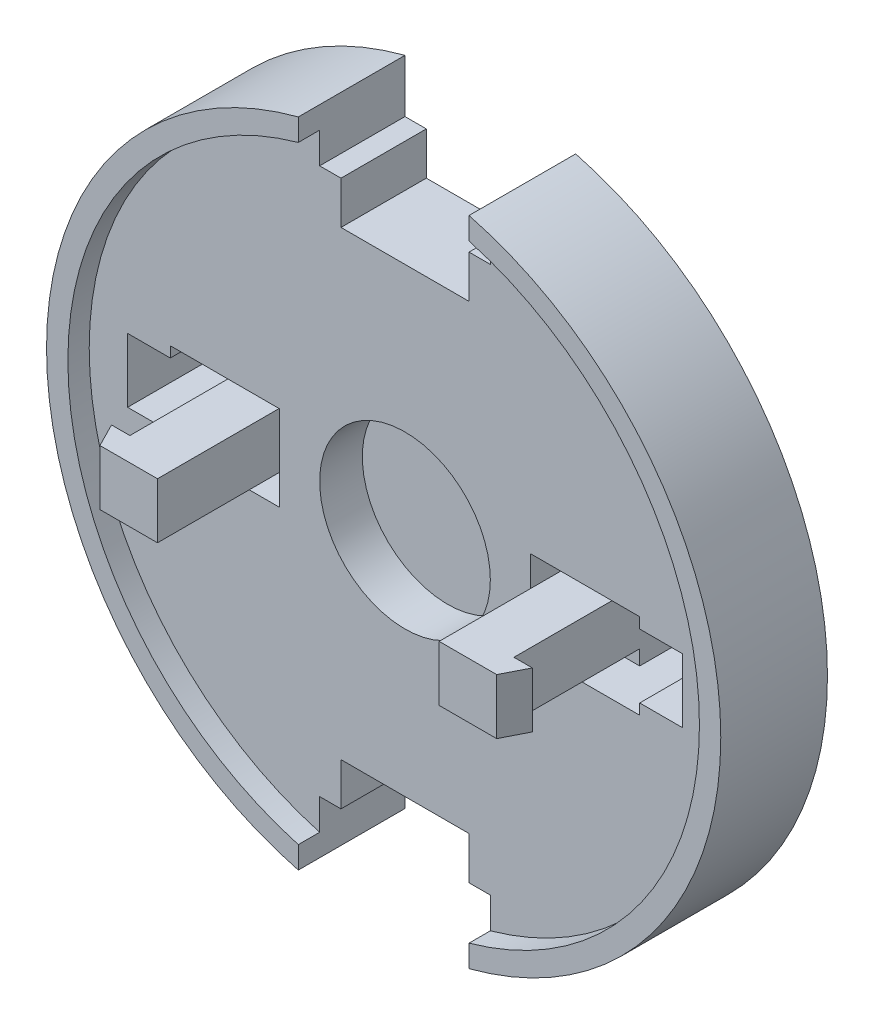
ISO-10303-21;
HEADER;
FILE_DESCRIPTION(('STEP AP214'),'2;1');
FILE_NAME('part.step','',(''),(''),'','','');
FILE_SCHEMA(('AUTOMOTIVE_DESIGN { 1 0 10303 214 1 1 1 1 }'));
ENDSEC;
DATA;
#1=APPLICATION_CONTEXT('core data for automotive mechanical design processes');
#2=APPLICATION_PROTOCOL_DEFINITION('international standard','automotive_design',2000,#1);
#3=PRODUCT_CONTEXT('',#1,'mechanical');
#4=PRODUCT('Part','Part','',(#3));
#5=PRODUCT_RELATED_PRODUCT_CATEGORY('part','',(#4));
#6=PRODUCT_DEFINITION_FORMATION('','',#4);
#7=PRODUCT_DEFINITION_CONTEXT('part definition',#1,'design');
#8=PRODUCT_DEFINITION('design','',#6,#7);
#9=PRODUCT_DEFINITION_SHAPE('','',#8);
#10=(LENGTH_UNIT() NAMED_UNIT(*) SI_UNIT(.MILLI.,.METRE.));
#11=(NAMED_UNIT(*) PLANE_ANGLE_UNIT() SI_UNIT($,.RADIAN.));
#12=(NAMED_UNIT(*) SI_UNIT($,.STERADIAN.) SOLID_ANGLE_UNIT());
#13=UNCERTAINTY_MEASURE_WITH_UNIT(LENGTH_MEASURE(1.E-05),#10,'distance_accuracy_value','');
#14=(GEOMETRIC_REPRESENTATION_CONTEXT(3) GLOBAL_UNCERTAINTY_ASSIGNED_CONTEXT((#13)) GLOBAL_UNIT_ASSIGNED_CONTEXT((#10,
#11,#12)) REPRESENTATION_CONTEXT('',''));
#15=CARTESIAN_POINT('',(0.,0.,0.));
#16=DIRECTION('',(0.,0.,1.));
#17=DIRECTION('',(1.,0.,0.));
#18=AXIS2_PLACEMENT_3D('',#15,#16,#17);
#19=CARTESIAN_POINT('',(4.93052748,-0.65,-9.553084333));
#20=DIRECTION('',(-0.891016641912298,0.,-0.453970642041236));
#21=DIRECTION('',(-0.453970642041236,0.,0.891016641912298));
#22=AXIS2_PLACEMENT_3D('',#19,#20,#21);
#23=PLANE('',#22);
#24=DIRECTION('',(0.,1.,0.));
#25=VECTOR('',#24,1.);
#26=CARTESIAN_POINT('',(4.93052748,0.,-9.553084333));
#27=LINE('',#26,#25);
#28=CARTESIAN_POINT('',(4.93052748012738,-0.65,-9.553084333));
#29=VERTEX_POINT('',#28);
#30=CARTESIAN_POINT('',(4.93052748,0.65,-9.553084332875));
#31=VERTEX_POINT('',#30);
#32=EDGE_CURVE('E175',#29,#31,#27,.T.);
#33=ORIENTED_EDGE('',*,*,#32,.T.);
#34=DIRECTION('',(0.453970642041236,0.,-0.891016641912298));
#35=VECTOR('',#34,1.);
#36=CARTESIAN_POINT('',(4.7896299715,0.65,-9.2765421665));
#37=LINE('',#36,#35);
#38=CARTESIAN_POINT('',(4.64873246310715,0.65,-9.));
#39=VERTEX_POINT('',#38);
#40=EDGE_CURVE('E560',#39,#31,#37,.T.);
#41=ORIENTED_EDGE('',*,*,#40,.F.);
#42=DIRECTION('',(0.,-1.,0.));
#43=VECTOR('',#42,1.);
#44=CARTESIAN_POINT('',(4.648732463,0.,-9.));
#45=LINE('',#44,#43);
#46=CARTESIAN_POINT('',(4.64873246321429,-0.65,-9.));
#47=VERTEX_POINT('',#46);
#48=EDGE_CURVE('E558',#39,#47,#45,.T.);
#49=ORIENTED_EDGE('',*,*,#48,.T.);
#50=DIRECTION('',(-0.4539706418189,0.,0.891016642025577));
#51=VECTOR('',#50,1.);
#52=CARTESIAN_POINT('',(4.93052748,-0.65,-9.5530843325));
#53=LINE('',#52,#51);
#54=EDGE_CURVE('E21',#29,#47,#53,.T.);
#55=ORIENTED_EDGE('',*,*,#54,.F.);
#56=EDGE_LOOP('',(#33,#41,#49,#55));
#57=FACE_BOUND('',#56,.T.);
#58=ADVANCED_FACE('F17',(#57),#23,.F.);
#59=CARTESIAN_POINT('',(4.648732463,-0.65,-9.));
#60=DIRECTION('',(0.,0.,-1.));
#61=DIRECTION('',(-1.,0.,0.));
#62=AXIS2_PLACEMENT_3D('',#59,#60,#61);
#63=PLANE('',#62);
#64=ORIENTED_EDGE('',*,*,#48,.F.);
#65=DIRECTION('',(-1.,0.,0.));
#66=VECTOR('',#65,1.);
#67=CARTESIAN_POINT('',(4.11526374,0.65,-9.));
#68=LINE('',#67,#66);
#69=CARTESIAN_POINT('',(3.3,0.65,-9.));
#70=VERTEX_POINT('',#69);
#71=EDGE_CURVE('E854',#39,#70,#68,.T.);
#72=ORIENTED_EDGE('',*,*,#71,.T.);
#73=DIRECTION('',(0.,-1.,0.));
#74=VECTOR('',#73,1.);
#75=CARTESIAN_POINT('',(3.3,0.,-9.));
#76=LINE('',#75,#74);
#77=CARTESIAN_POINT('',(3.3,-0.65,-9.));
#78=VERTEX_POINT('',#77);
#79=EDGE_CURVE('E862',#70,#78,#76,.T.);
#80=ORIENTED_EDGE('',*,*,#79,.T.);
#81=DIRECTION('',(-1.,0.,0.));
#82=VECTOR('',#81,1.);
#83=CARTESIAN_POINT('',(4.11526374,-0.65,-9.));
#84=LINE('',#83,#82);
#85=EDGE_CURVE('E555',#47,#78,#84,.T.);
#86=ORIENTED_EDGE('',*,*,#85,.F.);
#87=EDGE_LOOP('',(#64,#72,#80,#86));
#88=FACE_BOUND('',#87,.T.);
#89=ADVANCED_FACE('F910',(#88),#63,.F.);
#90=CARTESIAN_POINT('',(3.3,-0.65,-9.));
#91=DIRECTION('',(1.,0.,0.));
#92=DIRECTION('',(0.,0.,-1.));
#93=AXIS2_PLACEMENT_3D('',#90,#91,#92);
#94=PLANE('',#93);
#95=ORIENTED_EDGE('',*,*,#79,.F.);
#96=DIRECTION('',(0.,0.,-1.));
#97=VECTOR('',#96,1.);
#98=CARTESIAN_POINT('',(3.3,0.65,-10.75));
#99=LINE('',#98,#97);
#100=CARTESIAN_POINT('',(3.29999999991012,0.65,-12.5));
#101=VERTEX_POINT('',#100);
#102=EDGE_CURVE('E852',#70,#101,#99,.T.);
#103=ORIENTED_EDGE('',*,*,#102,.T.);
#104=DIRECTION('',(0.,1.,0.));
#105=VECTOR('',#104,1.);
#106=CARTESIAN_POINT('',(3.3,0.,-12.5));
#107=LINE('',#106,#105);
#108=CARTESIAN_POINT('',(3.29999999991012,-0.65,-12.5));
#109=VERTEX_POINT('',#108);
#110=EDGE_CURVE('E192',#109,#101,#107,.T.);
#111=ORIENTED_EDGE('',*,*,#110,.F.);
#112=DIRECTION('',(0.,0.,-1.));
#113=VECTOR('',#112,1.);
#114=CARTESIAN_POINT('',(3.3,-0.65,-10.75));
#115=LINE('',#114,#113);
#116=EDGE_CURVE('E513',#78,#109,#115,.T.);
#117=ORIENTED_EDGE('',*,*,#116,.F.);
#118=EDGE_LOOP('',(#95,#103,#111,#117));
#119=FACE_BOUND('',#118,.T.);
#120=ADVANCED_FACE('F861',(#119),#94,.F.);
#121=CARTESIAN_POINT('',(-4.93052748,-0.65,-9.553084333));
#122=DIRECTION('',(-0.891016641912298,0.,0.453970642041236));
#123=DIRECTION('',(0.453970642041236,0.,0.891016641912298));
#124=AXIS2_PLACEMENT_3D('',#121,#122,#123);
#125=PLANE('',#124);
#126=DIRECTION('',(0.453970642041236,0.,0.891016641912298));
#127=VECTOR('',#126,1.);
#128=CARTESIAN_POINT('',(-4.93052748,0.65,-9.553084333));
#129=LINE('',#128,#127);
#130=CARTESIAN_POINT('',(-4.648732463,0.65,-9.));
#131=VERTEX_POINT('',#130);
#132=CARTESIAN_POINT('',(-4.93052748,0.65,-9.553084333));
#133=VERTEX_POINT('',#132);
#134=EDGE_CURVE('E568',#131,#133,#129,.F.);
#135=ORIENTED_EDGE('',*,*,#134,.T.);
#136=DIRECTION('',(0.,1.,0.));
#137=VECTOR('',#136,1.);
#138=CARTESIAN_POINT('',(-4.93052748,0.,-9.553084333));
#139=LINE('',#138,#137);
#140=CARTESIAN_POINT('',(-4.93052748,-0.65,-9.553084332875));
#141=VERTEX_POINT('',#140);
#142=EDGE_CURVE('E570',#141,#133,#139,.T.);
#143=ORIENTED_EDGE('',*,*,#142,.F.);
#144=DIRECTION('',(0.453970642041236,0.,0.891016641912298));
#145=VECTOR('',#144,1.);
#146=CARTESIAN_POINT('',(-4.7896299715,-0.65,-9.2765421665));
#147=LINE('',#146,#145);
#148=CARTESIAN_POINT('',(-4.64873246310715,-0.65,-9.));
#149=VERTEX_POINT('',#148);
#150=EDGE_CURVE('E865',#141,#149,#147,.T.);
#151=ORIENTED_EDGE('',*,*,#150,.T.);
#152=DIRECTION('',(0.,-1.,0.));
#153=VECTOR('',#152,1.);
#154=CARTESIAN_POINT('',(-4.648732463,0.,-9.));
#155=LINE('',#154,#153);
#156=EDGE_CURVE('E546',#131,#149,#155,.T.);
#157=ORIENTED_EDGE('',*,*,#156,.F.);
#158=EDGE_LOOP('',(#135,#143,#151,#157));
#159=FACE_BOUND('',#158,.T.);
#160=ADVANCED_FACE('F883',(#159),#125,.T.);
#161=CARTESIAN_POINT('',(-3.3,-0.65,-9.));
#162=DIRECTION('',(1.,0.,0.));
#163=DIRECTION('',(0.,0.,-1.));
#164=AXIS2_PLACEMENT_3D('',#161,#162,#163);
#165=PLANE('',#164);
#166=DIRECTION('',(0.,0.,1.));
#167=VECTOR('',#166,1.);
#168=CARTESIAN_POINT('',(-3.3,0.65,-10.75));
#169=LINE('',#168,#167);
#170=CARTESIAN_POINT('',(-3.29999999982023,0.65,-12.5));
#171=VERTEX_POINT('',#170);
#172=CARTESIAN_POINT('',(-3.3,0.65,-9.));
#173=VERTEX_POINT('',#172);
#174=EDGE_CURVE('E573',#171,#173,#169,.T.);
#175=ORIENTED_EDGE('',*,*,#174,.T.);
#176=DIRECTION('',(0.,1.,0.));
#177=VECTOR('',#176,1.);
#178=CARTESIAN_POINT('',(-3.3,0.,-9.));
#179=LINE('',#178,#177);
#180=CARTESIAN_POINT('',(-3.3,-0.65,-9.));
#181=VERTEX_POINT('',#180);
#182=EDGE_CURVE('E564',#181,#173,#179,.T.);
#183=ORIENTED_EDGE('',*,*,#182,.F.);
#184=DIRECTION('',(0.,0.,1.));
#185=VECTOR('',#184,1.);
#186=CARTESIAN_POINT('',(-3.3,-0.65,-10.75));
#187=LINE('',#186,#185);
#188=CARTESIAN_POINT('',(-3.29999999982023,-0.65,-12.5));
#189=VERTEX_POINT('',#188);
#190=EDGE_CURVE('E627',#189,#181,#187,.T.);
#191=ORIENTED_EDGE('',*,*,#190,.F.);
#192=DIRECTION('',(0.,1.,0.));
#193=VECTOR('',#192,1.);
#194=CARTESIAN_POINT('',(-3.3,0.,-12.5));
#195=LINE('',#194,#193);
#196=EDGE_CURVE('E867',#189,#171,#195,.T.);
#197=ORIENTED_EDGE('',*,*,#196,.T.);
#198=EDGE_LOOP('',(#175,#183,#191,#197));
#199=FACE_BOUND('',#198,.T.);
#200=ADVANCED_FACE('F881',(#199),#165,.T.);
#201=CARTESIAN_POINT('',(-4.648732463,-0.65,-9.));
#202=DIRECTION('',(0.,0.,1.));
#203=DIRECTION('',(1.,0.,0.));
#204=AXIS2_PLACEMENT_3D('',#201,#202,#203);
#205=PLANE('',#204);
#206=DIRECTION('',(-1.,0.,0.));
#207=VECTOR('',#206,1.);
#208=CARTESIAN_POINT('',(-4.11526374,0.65,-9.));
#209=LINE('',#208,#207);
#210=EDGE_CURVE('E565',#173,#131,#209,.T.);
#211=ORIENTED_EDGE('',*,*,#210,.T.);
#212=ORIENTED_EDGE('',*,*,#156,.T.);
#213=DIRECTION('',(-1.,0.,0.));
#214=VECTOR('',#213,1.);
#215=CARTESIAN_POINT('',(-4.11526374,-0.65,-9.));
#216=LINE('',#215,#214);
#217=EDGE_CURVE('E624',#181,#149,#216,.T.);
#218=ORIENTED_EDGE('',*,*,#217,.F.);
#219=ORIENTED_EDGE('',*,*,#182,.T.);
#220=EDGE_LOOP('',(#211,#212,#218,#219));
#221=FACE_BOUND('',#220,.T.);
#222=ADVANCED_FACE('F878',(#221),#205,.T.);
#223=CARTESIAN_POINT('',(2.,-7.642643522,-11.));
#224=DIRECTION('',(1.,0.,0.));
#225=DIRECTION('',(0.,0.,-1.));
#226=AXIS2_PLACEMENT_3D('',#223,#224,#225);
#227=PLANE('',#226);
#228=DIRECTION('',(0.,1.,0.));
#229=VECTOR('',#228,1.);
#230=CARTESIAN_POINT('',(2.,-7.021321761,-13.5));
#231=LINE('',#230,#229);
#232=CARTESIAN_POINT('',(2.00000000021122,-7.64264352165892,-13.5));
#233=VERTEX_POINT('',#232);
#234=CARTESIAN_POINT('',(2.,-6.4,-13.5));
#235=VERTEX_POINT('',#234);
#236=EDGE_CURVE('E457',#233,#235,#231,.T.);
#237=ORIENTED_EDGE('',*,*,#236,.F.);
#238=DIRECTION('',(0.,0.,-1.));
#239=VECTOR('',#238,1.);
#240=CARTESIAN_POINT('',(2.00000000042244,-7.64264352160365,-12.25));
#241=LINE('',#240,#239);
#242=CARTESIAN_POINT('',(2.00000000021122,-7.64264352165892,-11.));
#243=VERTEX_POINT('',#242);
#244=EDGE_CURVE('E428',#233,#243,#241,.F.);
#245=ORIENTED_EDGE('',*,*,#244,.T.);
#246=DIRECTION('',(0.,-1.,0.));
#247=VECTOR('',#246,1.);
#248=CARTESIAN_POINT('',(2.,-7.021321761,-11.));
#249=LINE('',#248,#247);
#250=CARTESIAN_POINT('',(2.,-7.12460525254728,-11.));
#251=VERTEX_POINT('',#250);
#252=EDGE_CURVE('E459',#251,#243,#249,.T.);
#253=ORIENTED_EDGE('',*,*,#252,.F.);
#254=DIRECTION('',(0.,0.,1.));
#255=VECTOR('',#254,1.);
#256=CARTESIAN_POINT('',(2.,-7.1246052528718,-12.25));
#257=LINE('',#256,#255);
#258=CARTESIAN_POINT('',(2.,-7.12460525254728,-11.5));
#259=VERTEX_POINT('',#258);
#260=EDGE_CURVE('E463',#259,#251,#257,.T.);
#261=ORIENTED_EDGE('',*,*,#260,.F.);
#262=DIRECTION('',(0.,-1.,0.));
#263=VECTOR('',#262,1.);
#264=CARTESIAN_POINT('',(2.,-7.021321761,-11.5));
#265=LINE('',#264,#263);
#266=CARTESIAN_POINT('',(2.,-6.39999999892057,-11.5));
#267=VERTEX_POINT('',#266);
#268=EDGE_CURVE('E543',#267,#259,#265,.T.);
#269=ORIENTED_EDGE('',*,*,#268,.F.);
#270=DIRECTION('',(0.,0.,-1.));
#271=VECTOR('',#270,1.);
#272=CARTESIAN_POINT('',(2.,-6.4,-12.5));
#273=LINE('',#272,#271);
#274=EDGE_CURVE('E534',#267,#235,#273,.T.);
#275=ORIENTED_EDGE('',*,*,#274,.T.);
#276=EDGE_LOOP('',(#237,#245,#253,#261,#269,#275));
#277=FACE_BOUND('',#276,.T.);
#278=ADVANCED_FACE('F890',(#277),#227,.F.);
#279=CARTESIAN_POINT('',(2.,6.4,-11.));
#280=DIRECTION('',(1.,0.,0.));
#281=DIRECTION('',(0.,0.,-1.));
#282=AXIS2_PLACEMENT_3D('',#279,#280,#281);
#283=PLANE('',#282);
#284=DIRECTION('',(0.,-1.,0.));
#285=VECTOR('',#284,1.);
#286=CARTESIAN_POINT('',(2.,7.021321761,-11.));
#287=LINE('',#286,#285);
#288=CARTESIAN_POINT('',(2.00000000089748,7.64264352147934,-11.));
#289=VERTEX_POINT('',#288);
#290=CARTESIAN_POINT('',(2.,7.12460525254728,-11.));
#291=VERTEX_POINT('',#290);
#292=EDGE_CURVE('E448',#289,#291,#287,.T.);
#293=ORIENTED_EDGE('',*,*,#292,.F.);
#294=DIRECTION('',(0.,0.,1.));
#295=VECTOR('',#294,1.);
#296=CARTESIAN_POINT('',(2.00000000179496,7.64264352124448,-12.25));
#297=LINE('',#296,#295);
#298=CARTESIAN_POINT('',(2.00000000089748,7.64264352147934,-13.5));
#299=VERTEX_POINT('',#298);
#300=EDGE_CURVE('E424',#289,#299,#297,.F.);
#301=ORIENTED_EDGE('',*,*,#300,.T.);
#302=DIRECTION('',(0.,1.,0.));
#303=VECTOR('',#302,1.);
#304=CARTESIAN_POINT('',(2.,7.021321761,-13.5));
#305=LINE('',#304,#303);
#306=CARTESIAN_POINT('',(2.,6.4,-13.5));
#307=VERTEX_POINT('',#306);
#308=EDGE_CURVE('E452',#307,#299,#305,.T.);
#309=ORIENTED_EDGE('',*,*,#308,.F.);
#310=DIRECTION('',(0.,0.,1.));
#311=VECTOR('',#310,1.);
#312=CARTESIAN_POINT('',(2.,6.4,-12.5));
#313=LINE('',#312,#311);
#314=CARTESIAN_POINT('',(2.,6.39999999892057,-11.5));
#315=VERTEX_POINT('',#314);
#316=EDGE_CURVE('E518',#307,#315,#313,.T.);
#317=ORIENTED_EDGE('',*,*,#316,.T.);
#318=DIRECTION('',(0.,-1.,0.));
#319=VECTOR('',#318,1.);
#320=CARTESIAN_POINT('',(2.,7.021321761,-11.5));
#321=LINE('',#320,#319);
#322=CARTESIAN_POINT('',(2.,7.12460525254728,-11.5));
#323=VERTEX_POINT('',#322);
#324=EDGE_CURVE('E454',#323,#315,#321,.T.);
#325=ORIENTED_EDGE('',*,*,#324,.F.);
#326=DIRECTION('',(0.,0.,-1.));
#327=VECTOR('',#326,1.);
#328=CARTESIAN_POINT('',(2.,7.1246052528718,-12.25));
#329=LINE('',#328,#327);
#330=EDGE_CURVE('E451',#291,#323,#329,.T.);
#331=ORIENTED_EDGE('',*,*,#330,.F.);
#332=EDGE_LOOP('',(#293,#301,#309,#317,#325,#331));
#333=FACE_BOUND('',#332,.T.);
#334=ADVANCED_FACE('F930',(#333),#283,.F.);
#335=CARTESIAN_POINT('',(3.3,-0.65,-9.));
#336=DIRECTION('',(0.,-1.,0.));
#337=DIRECTION('',(0.,0.,-1.));
#338=AXIS2_PLACEMENT_3D('',#335,#336,#337);
#339=PLANE('',#338);
#340=ORIENTED_EDGE('',*,*,#54,.T.);
#341=ORIENTED_EDGE('',*,*,#85,.T.);
#342=ORIENTED_EDGE('',*,*,#116,.T.);
#343=DIRECTION('',(1.,0.,0.));
#344=VECTOR('',#343,1.);
#345=CARTESIAN_POINT('',(4.11526374,-0.65,-12.5));
#346=LINE('',#345,#344);
#347=CARTESIAN_POINT('',(4.49999999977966,-0.65,-12.5000000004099));
#348=VERTEX_POINT('',#347);
#349=EDGE_CURVE('E844',#109,#348,#346,.T.);
#350=ORIENTED_EDGE('',*,*,#349,.T.);
#351=DIRECTION('',(0.,0.,1.));
#352=VECTOR('',#351,1.);
#353=CARTESIAN_POINT('',(4.5,-0.65,-11.5265421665));
#354=LINE('',#353,#352);
#355=CARTESIAN_POINT('',(4.49999999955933,-0.65,-9.55308433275));
#356=VERTEX_POINT('',#355);
#357=EDGE_CURVE('E647',#348,#356,#354,.T.);
#358=ORIENTED_EDGE('',*,*,#357,.T.);
#359=DIRECTION('',(1.,0.,0.));
#360=VECTOR('',#359,1.);
#361=CARTESIAN_POINT('',(4.71526374,-0.65,-9.553084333));
#362=LINE('',#361,#360);
#363=EDGE_CURVE('E554',#356,#29,#362,.T.);
#364=ORIENTED_EDGE('',*,*,#363,.T.);
#365=EDGE_LOOP('',(#340,#341,#342,#350,#358,#364));
#366=FACE_BOUND('',#365,.T.);
#367=ADVANCED_FACE('F938',(#366),#339,.T.);
#368=CARTESIAN_POINT('',(4.5,-0.65,-9.553084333));
#369=DIRECTION('',(0.,0.,1.));
#370=DIRECTION('',(1.,0.,0.));
#371=AXIS2_PLACEMENT_3D('',#368,#369,#370);
#372=PLANE('',#371);
#373=DIRECTION('',(0.,1.,0.));
#374=VECTOR('',#373,1.);
#375=CARTESIAN_POINT('',(4.5,0.,-9.553084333));
#376=LINE('',#375,#374);
#377=CARTESIAN_POINT('',(4.49999999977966,0.65,-9.553084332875));
#378=VERTEX_POINT('',#377);
#379=EDGE_CURVE('E644',#356,#378,#376,.T.);
#380=ORIENTED_EDGE('',*,*,#379,.T.);
#381=DIRECTION('',(1.,0.,0.));
#382=VECTOR('',#381,1.);
#383=CARTESIAN_POINT('',(4.11526374,0.65,-9.5530843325));
#384=LINE('',#383,#382);
#385=EDGE_CURVE('E557',#378,#31,#384,.T.);
#386=ORIENTED_EDGE('',*,*,#385,.T.);
#387=ORIENTED_EDGE('',*,*,#32,.F.);
#388=ORIENTED_EDGE('',*,*,#363,.F.);
#389=EDGE_LOOP('',(#380,#386,#387,#388));
#390=FACE_BOUND('',#389,.T.);
#391=ADVANCED_FACE('F856',(#390),#372,.F.);
#392=CARTESIAN_POINT('',(3.3,0.65,-9.));
#393=DIRECTION('',(0.,-1.,0.));
#394=DIRECTION('',(0.,0.,-1.));
#395=AXIS2_PLACEMENT_3D('',#392,#393,#394);
#396=PLANE('',#395);
#397=DIRECTION('',(1.,0.,0.));
#398=VECTOR('',#397,1.);
#399=CARTESIAN_POINT('',(4.11526374,0.65,-12.5));
#400=LINE('',#399,#398);
#401=CARTESIAN_POINT('',(4.49999999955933,0.65,-12.5000000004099));
#402=VERTEX_POINT('',#401);
#403=EDGE_CURVE('E569',#101,#402,#400,.T.);
#404=ORIENTED_EDGE('',*,*,#403,.F.);
#405=ORIENTED_EDGE('',*,*,#102,.F.);
#406=ORIENTED_EDGE('',*,*,#71,.F.);
#407=ORIENTED_EDGE('',*,*,#40,.T.);
#408=ORIENTED_EDGE('',*,*,#385,.F.);
#409=DIRECTION('',(0.,0.,-1.));
#410=VECTOR('',#409,1.);
#411=CARTESIAN_POINT('',(4.5,0.65,-11.5265421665));
#412=LINE('',#411,#410);
#413=EDGE_CURVE('E641',#378,#402,#412,.T.);
#414=ORIENTED_EDGE('',*,*,#413,.T.);
#415=EDGE_LOOP('',(#404,#405,#406,#407,#408,#414));
#416=FACE_BOUND('',#415,.T.);
#417=ADVANCED_FACE('F858',(#416),#396,.F.);
#418=CARTESIAN_POINT('',(-4.93052748,0.65,-9.));
#419=DIRECTION('',(0.,-1.,0.));
#420=DIRECTION('',(0.,0.,-1.));
#421=AXIS2_PLACEMENT_3D('',#418,#419,#420);
#422=PLANE('',#421);
#423=DIRECTION('',(1.,0.,0.));
#424=VECTOR('',#423,1.);
#425=CARTESIAN_POINT('',(-4.11526374,0.65,-12.5));
#426=LINE('',#425,#424);
#427=CARTESIAN_POINT('',(-4.49999999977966,0.65,-12.5000000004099));
#428=VERTEX_POINT('',#427);
#429=EDGE_CURVE('E609',#428,#171,#426,.T.);
#430=ORIENTED_EDGE('',*,*,#429,.F.);
#431=DIRECTION('',(0.,0.,1.));
#432=VECTOR('',#431,1.);
#433=CARTESIAN_POINT('',(-4.5,0.65,-11.5265421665));
#434=LINE('',#433,#432);
#435=CARTESIAN_POINT('',(-4.49999999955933,0.65,-9.55308433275));
#436=VERTEX_POINT('',#435);
#437=EDGE_CURVE('E662',#428,#436,#434,.T.);
#438=ORIENTED_EDGE('',*,*,#437,.T.);
#439=DIRECTION('',(1.,0.,0.));
#440=VECTOR('',#439,1.);
#441=CARTESIAN_POINT('',(-4.71526374,0.65,-9.553084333));
#442=LINE('',#441,#440);
#443=EDGE_CURVE('E572',#133,#436,#442,.T.);
#444=ORIENTED_EDGE('',*,*,#443,.F.);
#445=ORIENTED_EDGE('',*,*,#134,.F.);
#446=ORIENTED_EDGE('',*,*,#210,.F.);
#447=ORIENTED_EDGE('',*,*,#174,.F.);
#448=EDGE_LOOP('',(#430,#438,#444,#445,#446,#447));
#449=FACE_BOUND('',#448,.T.);
#450=ADVANCED_FACE('F880',(#449),#422,.F.);
#451=CARTESIAN_POINT('',(-4.5,-0.65,-9.553084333));
#452=DIRECTION('',(0.,0.,-1.));
#453=DIRECTION('',(-1.,0.,0.));
#454=AXIS2_PLACEMENT_3D('',#451,#452,#453);
#455=PLANE('',#454);
#456=ORIENTED_EDGE('',*,*,#443,.T.);
#457=DIRECTION('',(0.,-1.,0.));
#458=VECTOR('',#457,1.);
#459=CARTESIAN_POINT('',(-4.5,0.,-9.553084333));
#460=LINE('',#459,#458);
#461=CARTESIAN_POINT('',(-4.49999999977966,-0.65,-9.553084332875));
#462=VERTEX_POINT('',#461);
#463=EDGE_CURVE('E659',#436,#462,#460,.T.);
#464=ORIENTED_EDGE('',*,*,#463,.T.);
#465=DIRECTION('',(1.,0.,0.));
#466=VECTOR('',#465,1.);
#467=CARTESIAN_POINT('',(-4.11526374,-0.65,-9.5530843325));
#468=LINE('',#467,#466);
#469=EDGE_CURVE('E503',#141,#462,#468,.T.);
#470=ORIENTED_EDGE('',*,*,#469,.F.);
#471=ORIENTED_EDGE('',*,*,#142,.T.);
#472=EDGE_LOOP('',(#456,#464,#470,#471));
#473=FACE_BOUND('',#472,.T.);
#474=ADVANCED_FACE('F964',(#473),#455,.T.);
#475=CARTESIAN_POINT('',(-4.93052748,-0.65,-9.));
#476=DIRECTION('',(0.,-1.,0.));
#477=DIRECTION('',(0.,0.,-1.));
#478=AXIS2_PLACEMENT_3D('',#475,#476,#477);
#479=PLANE('',#478);
#480=ORIENTED_EDGE('',*,*,#150,.F.);
#481=ORIENTED_EDGE('',*,*,#469,.T.);
#482=DIRECTION('',(0.,0.,-1.));
#483=VECTOR('',#482,1.);
#484=CARTESIAN_POINT('',(-4.5,-0.65,-11.5265421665));
#485=LINE('',#484,#483);
#486=CARTESIAN_POINT('',(-4.49999999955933,-0.65,-12.5000000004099));
#487=VERTEX_POINT('',#486);
#488=EDGE_CURVE('E656',#462,#487,#485,.T.);
#489=ORIENTED_EDGE('',*,*,#488,.T.);
#490=DIRECTION('',(1.,0.,0.));
#491=VECTOR('',#490,1.);
#492=CARTESIAN_POINT('',(-4.11526374,-0.65,-12.5));
#493=LINE('',#492,#491);
#494=EDGE_CURVE('E574',#487,#189,#493,.T.);
#495=ORIENTED_EDGE('',*,*,#494,.T.);
#496=ORIENTED_EDGE('',*,*,#190,.T.);
#497=ORIENTED_EDGE('',*,*,#217,.T.);
#498=EDGE_LOOP('',(#480,#481,#489,#495,#496,#497));
#499=FACE_BOUND('',#498,.T.);
#500=ADVANCED_FACE('F971',(#499),#479,.T.);
#501=CARTESIAN_POINT('',(-2.,6.4,-13.5));
#502=DIRECTION('',(-1.,0.,0.));
#503=DIRECTION('',(0.,0.,1.));
#504=AXIS2_PLACEMENT_3D('',#501,#502,#503);
#505=PLANE('',#504);
#506=DIRECTION('',(0.,-1.,0.));
#507=VECTOR('',#506,1.);
#508=CARTESIAN_POINT('',(-2.,7.021321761,-13.5));
#509=LINE('',#508,#507);
#510=CARTESIAN_POINT('',(-1.99999999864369,7.64264352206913,-13.5));
#511=VERTEX_POINT('',#510);
#512=CARTESIAN_POINT('',(-2.,6.4,-13.5));
#513=VERTEX_POINT('',#512);
#514=EDGE_CURVE('E441',#511,#513,#509,.T.);
#515=ORIENTED_EDGE('',*,*,#514,.F.);
#516=DIRECTION('',(0.,0.,-1.));
#517=VECTOR('',#516,1.);
#518=CARTESIAN_POINT('',(-1.99999999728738,7.64264352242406,-12.25));
#519=LINE('',#518,#517);
#520=CARTESIAN_POINT('',(-1.99999999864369,7.64264352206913,-11.));
#521=VERTEX_POINT('',#520);
#522=EDGE_CURVE('E416',#511,#521,#519,.F.);
#523=ORIENTED_EDGE('',*,*,#522,.T.);
#524=DIRECTION('',(0.,1.,0.));
#525=VECTOR('',#524,1.);
#526=CARTESIAN_POINT('',(-2.,7.021321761,-11.));
#527=LINE('',#526,#525);
#528=CARTESIAN_POINT('',(-2.,7.12460525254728,-11.));
#529=VERTEX_POINT('',#528);
#530=EDGE_CURVE('E443',#529,#521,#527,.T.);
#531=ORIENTED_EDGE('',*,*,#530,.F.);
#532=DIRECTION('',(0.,0.,1.));
#533=VECTOR('',#532,1.);
#534=CARTESIAN_POINT('',(-2.,7.1246052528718,-12.25));
#535=LINE('',#534,#533);
#536=CARTESIAN_POINT('',(-2.,7.12460525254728,-11.5));
#537=VERTEX_POINT('',#536);
#538=EDGE_CURVE('E447',#537,#529,#535,.T.);
#539=ORIENTED_EDGE('',*,*,#538,.F.);
#540=DIRECTION('',(0.,1.,0.));
#541=VECTOR('',#540,1.);
#542=CARTESIAN_POINT('',(-2.,7.021321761,-11.5));
#543=LINE('',#542,#541);
#544=CARTESIAN_POINT('',(-2.,6.39999999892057,-11.5));
#545=VERTEX_POINT('',#544);
#546=EDGE_CURVE('E500',#545,#537,#543,.T.);
#547=ORIENTED_EDGE('',*,*,#546,.F.);
#548=DIRECTION('',(0.,0.,-1.));
#549=VECTOR('',#548,1.);
#550=CARTESIAN_POINT('',(-2.,6.4,-12.5));
#551=LINE('',#550,#549);
#552=EDGE_CURVE('E490',#545,#513,#551,.T.);
#553=ORIENTED_EDGE('',*,*,#552,.T.);
#554=EDGE_LOOP('',(#515,#523,#531,#539,#547,#553));
#555=FACE_BOUND('',#554,.T.);
#556=ADVANCED_FACE('F979',(#555),#505,.F.);
#557=CARTESIAN_POINT('',(-2.,-7.642643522,-13.5));
#558=DIRECTION('',(-1.,0.,0.));
#559=DIRECTION('',(0.,0.,1.));
#560=AXIS2_PLACEMENT_3D('',#557,#558,#559);
#561=PLANE('',#560);
#562=DIRECTION('',(0.,1.,0.));
#563=VECTOR('',#562,1.);
#564=CARTESIAN_POINT('',(-2.,-7.021321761,-11.));
#565=LINE('',#564,#563);
#566=CARTESIAN_POINT('',(-1.99999999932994,-7.64264352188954,-11.));
#567=VERTEX_POINT('',#566);
#568=CARTESIAN_POINT('',(-2.,-7.12460525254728,-11.));
#569=VERTEX_POINT('',#568);
#570=EDGE_CURVE('E432',#567,#569,#565,.T.);
#571=ORIENTED_EDGE('',*,*,#570,.F.);
#572=DIRECTION('',(0.,0.,1.));
#573=VECTOR('',#572,1.);
#574=CARTESIAN_POINT('',(-1.99999999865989,-7.64264352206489,-12.25));
#575=LINE('',#574,#573);
#576=CARTESIAN_POINT('',(-1.99999999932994,-7.64264352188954,-13.5));
#577=VERTEX_POINT('',#576);
#578=EDGE_CURVE('E419',#567,#577,#575,.F.);
#579=ORIENTED_EDGE('',*,*,#578,.T.);
#580=DIRECTION('',(0.,-1.,0.));
#581=VECTOR('',#580,1.);
#582=CARTESIAN_POINT('',(-2.,-7.021321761,-13.5));
#583=LINE('',#582,#581);
#584=CARTESIAN_POINT('',(-2.,-6.4,-13.5));
#585=VERTEX_POINT('',#584);
#586=EDGE_CURVE('E436',#585,#577,#583,.T.);
#587=ORIENTED_EDGE('',*,*,#586,.F.);
#588=DIRECTION('',(0.,0.,1.));
#589=VECTOR('',#588,1.);
#590=CARTESIAN_POINT('',(-2.,-6.4,-12.5));
#591=LINE('',#590,#589);
#592=CARTESIAN_POINT('',(-2.,-6.39999999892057,-11.5));
#593=VERTEX_POINT('',#592);
#594=EDGE_CURVE('E420',#585,#593,#591,.T.);
#595=ORIENTED_EDGE('',*,*,#594,.T.);
#596=DIRECTION('',(0.,1.,0.));
#597=VECTOR('',#596,1.);
#598=CARTESIAN_POINT('',(-2.,-7.021321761,-11.5));
#599=LINE('',#598,#597);
#600=CARTESIAN_POINT('',(-2.,-7.12460525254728,-11.5));
#601=VERTEX_POINT('',#600);
#602=EDGE_CURVE('E438',#601,#593,#599,.T.);
#603=ORIENTED_EDGE('',*,*,#602,.F.);
#604=DIRECTION('',(0.,0.,-1.));
#605=VECTOR('',#604,1.);
#606=CARTESIAN_POINT('',(-2.,-7.1246052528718,-12.25));
#607=LINE('',#606,#605);
#608=EDGE_CURVE('E435',#569,#601,#607,.T.);
#609=ORIENTED_EDGE('',*,*,#608,.F.);
#610=EDGE_LOOP('',(#571,#579,#587,#595,#603,#609));
#611=FACE_BOUND('',#610,.T.);
#612=ADVANCED_FACE('F987',(#611),#561,.F.);
#613=CARTESIAN_POINT('',(-6.5,-0.75,-13.5));
#614=DIRECTION('',(-1.,0.,0.));
#615=DIRECTION('',(0.,0.,1.));
#616=AXIS2_PLACEMENT_3D('',#613,#614,#615);
#617=PLANE('',#616);
#618=DIRECTION('',(0.,-1.,0.));
#619=VECTOR('',#618,1.);
#620=CARTESIAN_POINT('',(-6.5,0.,-13.5));
#621=LINE('',#620,#619);
#622=CARTESIAN_POINT('',(-6.4999999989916,0.749999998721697,-13.5));
#623=VERTEX_POINT('',#622);
#624=CARTESIAN_POINT('',(-6.4999999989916,-0.749999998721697,-13.5));
#625=VERTEX_POINT('',#624);
#626=EDGE_CURVE('E630',#623,#625,#621,.T.);
#627=ORIENTED_EDGE('',*,*,#626,.F.);
#628=DIRECTION('',(0.,0.,1.));
#629=VECTOR('',#628,1.);
#630=CARTESIAN_POINT('',(-6.5,0.75,-12.5));
#631=LINE('',#630,#629);
#632=CARTESIAN_POINT('',(-6.4999999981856,0.750000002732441,-11.5));
#633=VERTEX_POINT('',#632);
#634=EDGE_CURVE('E678',#623,#633,#631,.T.);
#635=ORIENTED_EDGE('',*,*,#634,.T.);
#636=DIRECTION('',(0.,1.,0.));
#637=VECTOR('',#636,1.);
#638=CARTESIAN_POINT('',(-6.5,0.,-11.5));
#639=LINE('',#638,#637);
#640=CARTESIAN_POINT('',(-6.4999999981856,-0.75000000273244,-11.5));
#641=VERTEX_POINT('',#640);
#642=EDGE_CURVE('E466',#641,#633,#639,.T.);
#643=ORIENTED_EDGE('',*,*,#642,.F.);
#644=DIRECTION('',(0.,0.,-1.));
#645=VECTOR('',#644,1.);
#646=CARTESIAN_POINT('',(-6.5,-0.75,-12.5));
#647=LINE('',#646,#645);
#648=EDGE_CURVE('E672',#641,#625,#647,.T.);
#649=ORIENTED_EDGE('',*,*,#648,.T.);
#650=EDGE_LOOP('',(#627,#635,#643,#649));
#651=FACE_BOUND('',#650,.T.);
#652=ADVANCED_FACE('F995',(#651),#617,.F.);
#653=CARTESIAN_POINT('',(6.5,-0.75,-11.5));
#654=DIRECTION('',(1.,0.,0.));
#655=DIRECTION('',(0.,0.,-1.));
#656=AXIS2_PLACEMENT_3D('',#653,#654,#655);
#657=PLANE('',#656);
#658=DIRECTION('',(0.,1.,0.));
#659=VECTOR('',#658,1.);
#660=CARTESIAN_POINT('',(6.5,0.,-13.5));
#661=LINE('',#660,#659);
#662=CARTESIAN_POINT('',(6.4999999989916,-0.749999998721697,-13.5));
#663=VERTEX_POINT('',#662);
#664=CARTESIAN_POINT('',(6.4999999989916,0.749999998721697,-13.5));
#665=VERTEX_POINT('',#664);
#666=EDGE_CURVE('E508',#663,#665,#661,.T.);
#667=ORIENTED_EDGE('',*,*,#666,.F.);
#668=DIRECTION('',(0.,0.,1.));
#669=VECTOR('',#668,1.);
#670=CARTESIAN_POINT('',(6.5,-0.75,-12.5));
#671=LINE('',#670,#669);
#672=CARTESIAN_POINT('',(6.4999999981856,-0.75000000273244,-11.5));
#673=VERTEX_POINT('',#672);
#674=EDGE_CURVE('E690',#663,#673,#671,.T.);
#675=ORIENTED_EDGE('',*,*,#674,.T.);
#676=DIRECTION('',(0.,-1.,0.));
#677=VECTOR('',#676,1.);
#678=CARTESIAN_POINT('',(6.5,0.,-11.5));
#679=LINE('',#678,#677);
#680=CARTESIAN_POINT('',(6.4999999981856,0.750000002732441,-11.5));
#681=VERTEX_POINT('',#680);
#682=EDGE_CURVE('E632',#681,#673,#679,.T.);
#683=ORIENTED_EDGE('',*,*,#682,.F.);
#684=DIRECTION('',(0.,0.,-1.));
#685=VECTOR('',#684,1.);
#686=CARTESIAN_POINT('',(6.5,0.75,-12.5));
#687=LINE('',#686,#685);
#688=EDGE_CURVE('E684',#681,#665,#687,.T.);
#689=ORIENTED_EDGE('',*,*,#688,.T.);
#690=EDGE_LOOP('',(#667,#675,#683,#689));
#691=FACE_BOUND('',#690,.T.);
#692=ADVANCED_FACE('F833',(#691),#657,.F.);
#693=CARTESIAN_POINT('',(-2.,6.4,-11.5));
#694=DIRECTION('',(0.,-1.,0.));
#695=DIRECTION('',(0.,0.,-1.));
#696=AXIS2_PLACEMENT_3D('',#693,#694,#695);
#697=PLANE('',#696);
#698=DIRECTION('',(1.,0.,0.));
#699=VECTOR('',#698,1.);
#700=CARTESIAN_POINT('',(-1.75,6.4,-13.5));
#701=LINE('',#700,#699);
#702=CARTESIAN_POINT('',(-1.4999999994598,6.40000000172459,-13.5));
#703=VERTEX_POINT('',#702);
#704=EDGE_CURVE('E487',#513,#703,#701,.T.);
#705=ORIENTED_EDGE('',*,*,#704,.F.);
#706=ORIENTED_EDGE('',*,*,#552,.F.);
#707=DIRECTION('',(-1.,0.,0.));
#708=VECTOR('',#707,1.);
#709=CARTESIAN_POINT('',(-1.75,6.4,-11.5));
#710=LINE('',#709,#708);
#711=CARTESIAN_POINT('',(-1.5000000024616,6.39999999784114,-11.5));
#712=VERTEX_POINT('',#711);
#713=EDGE_CURVE('E495',#712,#545,#710,.T.);
#714=ORIENTED_EDGE('',*,*,#713,.F.);
#715=DIRECTION('',(0.,0.,-1.));
#716=VECTOR('',#715,1.);
#717=CARTESIAN_POINT('',(-1.5,6.4,-12.5));
#718=LINE('',#717,#716);
#719=EDGE_CURVE('E696',#712,#703,#718,.T.);
#720=ORIENTED_EDGE('',*,*,#719,.T.);
#721=EDGE_LOOP('',(#705,#706,#714,#720));
#722=FACE_BOUND('',#721,.T.);
#723=ADVANCED_FACE('F1010',(#722),#697,.F.);
#724=CARTESIAN_POINT('',(1.5,6.4,-11.5));
#725=DIRECTION('',(0.,-1.,0.));
#726=DIRECTION('',(0.,0.,-1.));
#727=AXIS2_PLACEMENT_3D('',#724,#725,#726);
#728=PLANE('',#727);
#729=DIRECTION('',(1.,0.,0.));
#730=VECTOR('',#729,1.);
#731=CARTESIAN_POINT('',(1.75,6.4,-13.5));
#732=LINE('',#731,#730);
#733=CARTESIAN_POINT('',(1.4999999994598,6.40000000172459,-13.5));
#734=VERTEX_POINT('',#733);
#735=EDGE_CURVE('E522',#734,#307,#732,.T.);
#736=ORIENTED_EDGE('',*,*,#735,.F.);
#737=DIRECTION('',(0.,0.,1.));
#738=VECTOR('',#737,1.);
#739=CARTESIAN_POINT('',(1.5,6.4,-12.5));
#740=LINE('',#739,#738);
#741=CARTESIAN_POINT('',(1.5000000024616,6.39999999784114,-11.5));
#742=VERTEX_POINT('',#741);
#743=EDGE_CURVE('E607',#734,#742,#740,.T.);
#744=ORIENTED_EDGE('',*,*,#743,.T.);
#745=DIRECTION('',(-1.,0.,0.));
#746=VECTOR('',#745,1.);
#747=CARTESIAN_POINT('',(1.75,6.4,-11.5));
#748=LINE('',#747,#746);
#749=EDGE_CURVE('E489',#315,#742,#748,.T.);
#750=ORIENTED_EDGE('',*,*,#749,.F.);
#751=ORIENTED_EDGE('',*,*,#316,.F.);
#752=EDGE_LOOP('',(#736,#744,#750,#751));
#753=FACE_BOUND('',#752,.T.);
#754=ADVANCED_FACE('F1017',(#753),#728,.F.);
#755=CARTESIAN_POINT('',(1.5,-6.4,-13.5));
#756=DIRECTION('',(0.,1.,0.));
#757=DIRECTION('',(0.,0.,1.));
#758=AXIS2_PLACEMENT_3D('',#755,#756,#757);
#759=PLANE('',#758);
#760=DIRECTION('',(-1.,0.,0.));
#761=VECTOR('',#760,1.);
#762=CARTESIAN_POINT('',(1.75,-6.4,-13.5));
#763=LINE('',#762,#761);
#764=CARTESIAN_POINT('',(1.4999999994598,-6.40000000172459,-13.5));
#765=VERTEX_POINT('',#764);
#766=EDGE_CURVE('E431',#235,#765,#763,.T.);
#767=ORIENTED_EDGE('',*,*,#766,.F.);
#768=ORIENTED_EDGE('',*,*,#274,.F.);
#769=DIRECTION('',(1.,0.,0.));
#770=VECTOR('',#769,1.);
#771=CARTESIAN_POINT('',(1.75,-6.4,-11.5));
#772=LINE('',#771,#770);
#773=CARTESIAN_POINT('',(1.5000000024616,-6.39999999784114,-11.5));
#774=VERTEX_POINT('',#773);
#775=EDGE_CURVE('E521',#774,#267,#772,.T.);
#776=ORIENTED_EDGE('',*,*,#775,.F.);
#777=DIRECTION('',(0.,0.,-1.));
#778=VECTOR('',#777,1.);
#779=CARTESIAN_POINT('',(1.5,-6.4,-12.5));
#780=LINE('',#779,#778);
#781=EDGE_CURVE('E705',#774,#765,#780,.T.);
#782=ORIENTED_EDGE('',*,*,#781,.T.);
#783=EDGE_LOOP('',(#767,#768,#776,#782));
#784=FACE_BOUND('',#783,.T.);
#785=ADVANCED_FACE('F1025',(#784),#759,.F.);
#786=CARTESIAN_POINT('',(0.,0.,-13.5));
#787=DIRECTION('',(0.,0.,1.));
#788=DIRECTION('',(0.,-1.,0.));
#789=AXIS2_PLACEMENT_3D('',#786,#787,#788);
#790=CYLINDRICAL_SURFACE('',#789,7.9);
#791=CARTESIAN_POINT('',(0.,0.,-13.5));
#792=DIRECTION('',(0.,0.,1.));
#793=DIRECTION('',(0.,-1.,0.));
#794=AXIS2_PLACEMENT_3D('',#791,#792,#793);
#795=CIRCLE('',#794,7.9);
#796=EDGE_CURVE('E599',#233,#299,#795,.T.);
#797=ORIENTED_EDGE('',*,*,#796,.T.);
#798=ORIENTED_EDGE('',*,*,#300,.F.);
#799=CARTESIAN_POINT('',(0.,0.,-11.));
#800=DIRECTION('',(0.,0.,1.));
#801=DIRECTION('',(0.,-1.,0.));
#802=AXIS2_PLACEMENT_3D('',#799,#800,#801);
#803=CIRCLE('',#802,7.9);
#804=EDGE_CURVE('E604',#289,#243,#803,.F.);
#805=ORIENTED_EDGE('',*,*,#804,.T.);
#806=ORIENTED_EDGE('',*,*,#244,.F.);
#807=EDGE_LOOP('',(#797,#798,#805,#806));
#808=FACE_BOUND('',#807,.T.);
#809=ADVANCED_FACE('F1033',(#808),#790,.T.);
#810=CARTESIAN_POINT('',(4.5,-1.,-13.5));
#811=DIRECTION('',(-1.,0.,0.));
#812=DIRECTION('',(0.,0.,1.));
#813=AXIS2_PLACEMENT_3D('',#810,#811,#812);
#814=PLANE('',#813);
#815=ORIENTED_EDGE('',*,*,#413,.F.);
#816=ORIENTED_EDGE('',*,*,#379,.F.);
#817=ORIENTED_EDGE('',*,*,#357,.F.);
#818=DIRECTION('',(0.,1.,0.));
#819=VECTOR('',#818,1.);
#820=CARTESIAN_POINT('',(4.5,0.,-12.5000000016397));
#821=LINE('',#820,#819);
#822=CARTESIAN_POINT('',(4.499999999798,-1.,-12.5000000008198));
#823=VERTEX_POINT('',#822);
#824=EDGE_CURVE('E650',#823,#348,#821,.T.);
#825=ORIENTED_EDGE('',*,*,#824,.F.);
#826=DIRECTION('',(0.,0.,1.));
#827=VECTOR('',#826,1.);
#828=CARTESIAN_POINT('',(4.5,-1.,-11.5265421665));
#829=LINE('',#828,#827);
#830=CARTESIAN_POINT('',(4.4999999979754,-1.00000000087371,-13.5));
#831=VERTEX_POINT('',#830);
#832=EDGE_CURVE('E367',#831,#823,#829,.T.);
#833=ORIENTED_EDGE('',*,*,#832,.F.);
#834=DIRECTION('',(0.,1.,0.));
#835=VECTOR('',#834,1.);
#836=CARTESIAN_POINT('',(4.4999999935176,0.,-13.5));
#837=LINE('',#836,#835);
#838=CARTESIAN_POINT('',(4.4999999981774,1.00000000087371,-13.5));
#839=VERTEX_POINT('',#838);
#840=EDGE_CURVE('E729',#831,#839,#837,.T.);
#841=ORIENTED_EDGE('',*,*,#840,.T.);
#842=DIRECTION('',(0.,0.,-1.));
#843=VECTOR('',#842,1.);
#844=CARTESIAN_POINT('',(4.5,1.,-11.5265421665));
#845=LINE('',#844,#843);
#846=CARTESIAN_POINT('',(4.499999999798,1.,-12.5000000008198));
#847=VERTEX_POINT('',#846);
#848=EDGE_CURVE('E427',#847,#839,#845,.T.);
#849=ORIENTED_EDGE('',*,*,#848,.F.);
#850=DIRECTION('',(0.,1.,0.));
#851=VECTOR('',#850,1.);
#852=CARTESIAN_POINT('',(4.5,0.,-12.5000000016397));
#853=LINE('',#852,#851);
#854=EDGE_CURVE('E638',#402,#847,#853,.T.);
#855=ORIENTED_EDGE('',*,*,#854,.F.);
#856=EDGE_LOOP('',(#815,#816,#817,#825,#833,#841,#849,#855));
#857=FACE_BOUND('',#856,.T.);
#858=ADVANCED_FACE('F839',(#857),#814,.F.);
#859=CARTESIAN_POINT('',(-4.5,-1.,-9.553084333));
#860=DIRECTION('',(1.,0.,0.));
#861=DIRECTION('',(0.,0.,-1.));
#862=AXIS2_PLACEMENT_3D('',#859,#860,#861);
#863=PLANE('',#862);
#864=ORIENTED_EDGE('',*,*,#488,.F.);
#865=ORIENTED_EDGE('',*,*,#463,.F.);
#866=ORIENTED_EDGE('',*,*,#437,.F.);
#867=DIRECTION('',(0.,-1.,0.));
#868=VECTOR('',#867,1.);
#869=CARTESIAN_POINT('',(-4.5,0.,-12.5000000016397));
#870=LINE('',#869,#868);
#871=CARTESIAN_POINT('',(-4.499999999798,1.,-12.5000000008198));
#872=VERTEX_POINT('',#871);
#873=EDGE_CURVE('E665',#872,#428,#870,.T.);
#874=ORIENTED_EDGE('',*,*,#873,.F.);
#875=DIRECTION('',(0.,0.,1.));
#876=VECTOR('',#875,1.);
#877=CARTESIAN_POINT('',(-4.5,1.,-11.5265421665));
#878=LINE('',#877,#876);
#879=CARTESIAN_POINT('',(-4.4999999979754,1.00000000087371,-13.5));
#880=VERTEX_POINT('',#879);
#881=EDGE_CURVE('E667',#880,#872,#878,.T.);
#882=ORIENTED_EDGE('',*,*,#881,.F.);
#883=DIRECTION('',(0.,-1.,0.));
#884=VECTOR('',#883,1.);
#885=CARTESIAN_POINT('',(-4.4999999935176,0.,-13.5));
#886=LINE('',#885,#884);
#887=CARTESIAN_POINT('',(-4.4999999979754,-1.00000000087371,-13.5));
#888=VERTEX_POINT('',#887);
#889=EDGE_CURVE('E710',#880,#888,#886,.T.);
#890=ORIENTED_EDGE('',*,*,#889,.T.);
#891=DIRECTION('',(0.,0.,-1.));
#892=VECTOR('',#891,1.);
#893=CARTESIAN_POINT('',(-4.5,-1.,-11.5265421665));
#894=LINE('',#893,#892);
#895=CARTESIAN_POINT('',(-4.499999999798,-1.,-12.5000000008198));
#896=VERTEX_POINT('',#895);
#897=EDGE_CURVE('E640',#896,#888,#894,.T.);
#898=ORIENTED_EDGE('',*,*,#897,.F.);
#899=DIRECTION('',(0.,-1.,0.));
#900=VECTOR('',#899,1.);
#901=CARTESIAN_POINT('',(-4.5,0.,-12.5000000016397));
#902=LINE('',#901,#900);
#903=EDGE_CURVE('E484',#487,#896,#902,.T.);
#904=ORIENTED_EDGE('',*,*,#903,.F.);
#905=EDGE_LOOP('',(#864,#865,#866,#874,#882,#890,#898,#904));
#906=FACE_BOUND('',#905,.T.);
#907=ADVANCED_FACE('F1048',(#906),#863,.F.);
#908=CARTESIAN_POINT('',(-2.,-6.4,-13.5));
#909=DIRECTION('',(0.,1.,0.));
#910=DIRECTION('',(0.,0.,1.));
#911=AXIS2_PLACEMENT_3D('',#908,#909,#910);
#912=PLANE('',#911);
#913=DIRECTION('',(1.,0.,0.));
#914=VECTOR('',#913,1.);
#915=CARTESIAN_POINT('',(0.,-6.40000000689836,-13.5));
#916=LINE('',#915,#914);
#917=CARTESIAN_POINT('',(-1.4999999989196,-6.40000000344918,-13.5));
#918=VERTEX_POINT('',#917);
#919=EDGE_CURVE('E476',#585,#918,#916,.T.);
#920=ORIENTED_EDGE('',*,*,#919,.T.);
#921=DIRECTION('',(0.,0.,1.));
#922=VECTOR('',#921,1.);
#923=CARTESIAN_POINT('',(-1.5,-6.4,-12.5));
#924=LINE('',#923,#922);
#925=CARTESIAN_POINT('',(-1.5000000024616,-6.39999999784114,-11.5));
#926=VERTEX_POINT('',#925);
#927=EDGE_CURVE('E595',#918,#926,#924,.T.);
#928=ORIENTED_EDGE('',*,*,#927,.T.);
#929=DIRECTION('',(1.,0.,0.));
#930=VECTOR('',#929,1.);
#931=CARTESIAN_POINT('',(-1.75,-6.4,-11.5));
#932=LINE('',#931,#930);
#933=EDGE_CURVE('E473',#593,#926,#932,.T.);
#934=ORIENTED_EDGE('',*,*,#933,.F.);
#935=ORIENTED_EDGE('',*,*,#594,.F.);
#936=EDGE_LOOP('',(#920,#928,#934,#935));
#937=FACE_BOUND('',#936,.T.);
#938=ADVANCED_FACE('F1055',(#937),#912,.F.);
#939=CARTESIAN_POINT('',(0.,0.,-13.5));
#940=DIRECTION('',(0.,0.,1.));
#941=DIRECTION('',(0.,-1.,0.));
#942=AXIS2_PLACEMENT_3D('',#939,#940,#941);
#943=CYLINDRICAL_SURFACE('',#942,7.9);
#944=ORIENTED_EDGE('',*,*,#578,.F.);
#945=CARTESIAN_POINT('',(0.,0.,-11.));
#946=DIRECTION('',(0.,0.,1.));
#947=DIRECTION('',(0.,-1.,0.));
#948=AXIS2_PLACEMENT_3D('',#945,#946,#947);
#949=CIRCLE('',#948,7.9);
#950=EDGE_CURVE('E591',#567,#521,#949,.F.);
#951=ORIENTED_EDGE('',*,*,#950,.T.);
#952=ORIENTED_EDGE('',*,*,#522,.F.);
#953=CARTESIAN_POINT('',(0.,0.,-13.5));
#954=DIRECTION('',(0.,0.,1.));
#955=DIRECTION('',(0.,-1.,0.));
#956=AXIS2_PLACEMENT_3D('',#953,#954,#955);
#957=CIRCLE('',#956,7.9);
#958=EDGE_CURVE('E479',#511,#577,#957,.T.);
#959=ORIENTED_EDGE('',*,*,#958,.T.);
#960=EDGE_LOOP('',(#944,#951,#952,#959));
#961=FACE_BOUND('',#960,.T.);
#962=ADVANCED_FACE('F1063',(#961),#943,.T.);
#963=CARTESIAN_POINT('',(-6.5,-0.75,-13.5));
#964=DIRECTION('',(0.,-1.,0.));
#965=DIRECTION('',(1.,0.,0.));
#966=AXIS2_PLACEMENT_3D('',#963,#964,#965);
#967=PLANE('',#966);
#968=DIRECTION('',(-1.,0.,0.));
#969=VECTOR('',#968,1.);
#970=CARTESIAN_POINT('',(0.,-0.749999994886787,-13.5));
#971=LINE('',#970,#969);
#972=CARTESIAN_POINT('',(-5.5000000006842,-0.749999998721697,-13.5));
#973=VERTEX_POINT('',#972);
#974=EDGE_CURVE('E719',#973,#625,#971,.T.);
#975=ORIENTED_EDGE('',*,*,#974,.T.);
#976=ORIENTED_EDGE('',*,*,#648,.F.);
#977=DIRECTION('',(-1.,0.,0.));
#978=VECTOR('',#977,1.);
#979=CARTESIAN_POINT('',(-6.,-0.75,-11.5));
#980=LINE('',#979,#978);
#981=CARTESIAN_POINT('',(-5.4999999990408,-0.75000000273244,-11.5));
#982=VERTEX_POINT('',#981);
#983=EDGE_CURVE('E423',#982,#641,#980,.T.);
#984=ORIENTED_EDGE('',*,*,#983,.F.);
#985=DIRECTION('',(0.,0.,-1.));
#986=VECTOR('',#985,1.);
#987=CARTESIAN_POINT('',(-5.5,-0.75,-12.5));
#988=LINE('',#987,#986);
#989=EDGE_CURVE('E749',#982,#973,#988,.T.);
#990=ORIENTED_EDGE('',*,*,#989,.T.);
#991=EDGE_LOOP('',(#975,#976,#984,#990));
#992=FACE_BOUND('',#991,.T.);
#993=ADVANCED_FACE('F1071',(#992),#967,.F.);
#994=CARTESIAN_POINT('',(-5.5,0.75,-13.5));
#995=DIRECTION('',(0.,1.,0.));
#996=DIRECTION('',(-1.,0.,0.));
#997=AXIS2_PLACEMENT_3D('',#994,#995,#996);
#998=PLANE('',#997);
#999=DIRECTION('',(1.,0.,0.));
#1000=VECTOR('',#999,1.);
#1001=CARTESIAN_POINT('',(0.,0.749999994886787,-13.5));
#1002=LINE('',#1001,#1000);
#1003=CARTESIAN_POINT('',(-5.5000000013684,0.749999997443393,-13.5));
#1004=VERTEX_POINT('',#1003);
#1005=EDGE_CURVE('E717',#623,#1004,#1002,.T.);
#1006=ORIENTED_EDGE('',*,*,#1005,.T.);
#1007=DIRECTION('',(0.,0.,1.));
#1008=VECTOR('',#1007,1.);
#1009=CARTESIAN_POINT('',(-5.5,0.75,-12.5));
#1010=LINE('',#1009,#1008);
#1011=CARTESIAN_POINT('',(-5.4999999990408,0.750000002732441,-11.5));
#1012=VERTEX_POINT('',#1011);
#1013=EDGE_CURVE('E756',#1004,#1012,#1010,.T.);
#1014=ORIENTED_EDGE('',*,*,#1013,.T.);
#1015=DIRECTION('',(1.,0.,0.));
#1016=VECTOR('',#1015,1.);
#1017=CARTESIAN_POINT('',(-6.,0.75,-11.5));
#1018=LINE('',#1017,#1016);
#1019=EDGE_CURVE('E675',#633,#1012,#1018,.T.);
#1020=ORIENTED_EDGE('',*,*,#1019,.F.);
#1021=ORIENTED_EDGE('',*,*,#634,.F.);
#1022=EDGE_LOOP('',(#1006,#1014,#1020,#1021));
#1023=FACE_BOUND('',#1022,.T.);
#1024=ADVANCED_FACE('F1079',(#1023),#998,.F.);
#1025=CARTESIAN_POINT('',(6.5,0.75,-13.5));
#1026=DIRECTION('',(0.,1.,0.));
#1027=DIRECTION('',(-1.,0.,0.));
#1028=AXIS2_PLACEMENT_3D('',#1025,#1026,#1027);
#1029=PLANE('',#1028);
#1030=DIRECTION('',(1.,0.,0.));
#1031=VECTOR('',#1030,1.);
#1032=CARTESIAN_POINT('',(0.,0.749999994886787,-13.5));
#1033=LINE('',#1032,#1031);
#1034=CARTESIAN_POINT('',(5.5000000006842,0.749999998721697,-13.5));
#1035=VERTEX_POINT('',#1034);
#1036=EDGE_CURVE('E724',#1035,#665,#1033,.T.);
#1037=ORIENTED_EDGE('',*,*,#1036,.T.);
#1038=ORIENTED_EDGE('',*,*,#688,.F.);
#1039=DIRECTION('',(1.,0.,0.));
#1040=VECTOR('',#1039,1.);
#1041=CARTESIAN_POINT('',(6.,0.75,-11.5));
#1042=LINE('',#1041,#1040);
#1043=CARTESIAN_POINT('',(5.4999999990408,0.750000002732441,-11.5));
#1044=VERTEX_POINT('',#1043);
#1045=EDGE_CURVE('E681',#1044,#681,#1042,.T.);
#1046=ORIENTED_EDGE('',*,*,#1045,.F.);
#1047=DIRECTION('',(0.,0.,-1.));
#1048=VECTOR('',#1047,1.);
#1049=CARTESIAN_POINT('',(5.5,0.75,-12.5));
#1050=LINE('',#1049,#1048);
#1051=EDGE_CURVE('E766',#1044,#1035,#1050,.T.);
#1052=ORIENTED_EDGE('',*,*,#1051,.T.);
#1053=EDGE_LOOP('',(#1037,#1038,#1046,#1052));
#1054=FACE_BOUND('',#1053,.T.);
#1055=ADVANCED_FACE('F836',(#1054),#1029,.F.);
#1056=CARTESIAN_POINT('',(5.5,-0.75,-13.5));
#1057=DIRECTION('',(0.,-1.,0.));
#1058=DIRECTION('',(1.,0.,0.));
#1059=AXIS2_PLACEMENT_3D('',#1056,#1057,#1058);
#1060=PLANE('',#1059);
#1061=DIRECTION('',(-1.,0.,0.));
#1062=VECTOR('',#1061,1.);
#1063=CARTESIAN_POINT('',(0.,-0.749999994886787,-13.5));
#1064=LINE('',#1063,#1062);
#1065=CARTESIAN_POINT('',(5.5000000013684,-0.749999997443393,-13.5));
#1066=VERTEX_POINT('',#1065);
#1067=EDGE_CURVE('E478',#663,#1066,#1064,.T.);
#1068=ORIENTED_EDGE('',*,*,#1067,.T.);
#1069=DIRECTION('',(0.,0.,1.));
#1070=VECTOR('',#1069,1.);
#1071=CARTESIAN_POINT('',(5.5,-0.75,-12.5));
#1072=LINE('',#1071,#1070);
#1073=CARTESIAN_POINT('',(5.4999999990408,-0.75000000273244,-11.5));
#1074=VERTEX_POINT('',#1073);
#1075=EDGE_CURVE('E771',#1066,#1074,#1072,.T.);
#1076=ORIENTED_EDGE('',*,*,#1075,.T.);
#1077=DIRECTION('',(-1.,0.,0.));
#1078=VECTOR('',#1077,1.);
#1079=CARTESIAN_POINT('',(6.,-0.75,-11.5));
#1080=LINE('',#1079,#1078);
#1081=EDGE_CURVE('E687',#673,#1074,#1080,.T.);
#1082=ORIENTED_EDGE('',*,*,#1081,.F.);
#1083=ORIENTED_EDGE('',*,*,#674,.F.);
#1084=EDGE_LOOP('',(#1068,#1076,#1082,#1083));
#1085=FACE_BOUND('',#1084,.T.);
#1086=ADVANCED_FACE('F831',(#1085),#1060,.F.);
#1087=CARTESIAN_POINT('',(-1.5,5.4,-13.5));
#1088=DIRECTION('',(-1.,0.,0.));
#1089=DIRECTION('',(0.,0.,1.));
#1090=AXIS2_PLACEMENT_3D('',#1087,#1088,#1089);
#1091=PLANE('',#1090);
#1092=DIRECTION('',(0.,1.,0.));
#1093=VECTOR('',#1092,1.);
#1094=CARTESIAN_POINT('',(-1.4999999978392,0.,-13.5));
#1095=LINE('',#1094,#1093);
#1096=CARTESIAN_POINT('',(-1.4999999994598,5.40000000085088,-13.5));
#1097=VERTEX_POINT('',#1096);
#1098=EDGE_CURVE('E598',#1097,#703,#1095,.T.);
#1099=ORIENTED_EDGE('',*,*,#1098,.T.);
#1100=ORIENTED_EDGE('',*,*,#719,.F.);
#1101=DIRECTION('',(0.,1.,0.));
#1102=VECTOR('',#1101,1.);
#1103=CARTESIAN_POINT('',(-1.5,5.9,-11.5));
#1104=LINE('',#1103,#1102);
#1105=CARTESIAN_POINT('',(-1.5000000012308,5.39999999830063,-11.5));
#1106=VERTEX_POINT('',#1105);
#1107=EDGE_CURVE('E693',#1106,#712,#1104,.T.);
#1108=ORIENTED_EDGE('',*,*,#1107,.F.);
#1109=DIRECTION('',(0.,0.,-1.));
#1110=VECTOR('',#1109,1.);
#1111=CARTESIAN_POINT('',(-1.5,5.4,-12.5));
#1112=LINE('',#1111,#1110);
#1113=EDGE_CURVE('E774',#1106,#1097,#1112,.T.);
#1114=ORIENTED_EDGE('',*,*,#1113,.T.);
#1115=EDGE_LOOP('',(#1099,#1100,#1108,#1114));
#1116=FACE_BOUND('',#1115,.T.);
#1117=ADVANCED_FACE('F1100',(#1116),#1091,.F.);
#1118=CARTESIAN_POINT('',(1.5,5.4,-11.5));
#1119=DIRECTION('',(1.,0.,0.));
#1120=DIRECTION('',(0.,0.,-1.));
#1121=AXIS2_PLACEMENT_3D('',#1118,#1119,#1120);
#1122=PLANE('',#1121);
#1123=DIRECTION('',(0.,-1.,0.));
#1124=VECTOR('',#1123,1.);
#1125=CARTESIAN_POINT('',(1.4999999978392,0.,-13.5));
#1126=LINE('',#1125,#1124);
#1127=CARTESIAN_POINT('',(1.4999999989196,5.40000000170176,-13.5));
#1128=VERTEX_POINT('',#1127);
#1129=EDGE_CURVE('E602',#734,#1128,#1126,.T.);
#1130=ORIENTED_EDGE('',*,*,#1129,.T.);
#1131=DIRECTION('',(0.,0.,1.));
#1132=VECTOR('',#1131,1.);
#1133=CARTESIAN_POINT('',(1.5,5.4,-12.5));
#1134=LINE('',#1133,#1132);
#1135=CARTESIAN_POINT('',(1.5000000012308,5.39999999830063,-11.5));
#1136=VERTEX_POINT('',#1135);
#1137=EDGE_CURVE('E590',#1128,#1136,#1134,.T.);
#1138=ORIENTED_EDGE('',*,*,#1137,.T.);
#1139=DIRECTION('',(0.,-1.,0.));
#1140=VECTOR('',#1139,1.);
#1141=CARTESIAN_POINT('',(1.5,5.9,-11.5));
#1142=LINE('',#1141,#1140);
#1143=EDGE_CURVE('E699',#742,#1136,#1142,.T.);
#1144=ORIENTED_EDGE('',*,*,#1143,.F.);
#1145=ORIENTED_EDGE('',*,*,#743,.F.);
#1146=EDGE_LOOP('',(#1130,#1138,#1144,#1145));
#1147=FACE_BOUND('',#1146,.T.);
#1148=ADVANCED_FACE('F1107',(#1147),#1122,.F.);
#1149=CARTESIAN_POINT('',(7.9354,-7.734355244,-11.));
#1150=DIRECTION('',(0.,0.,-1.));
#1151=DIRECTION('',(-1.,0.,0.));
#1152=AXIS2_PLACEMENT_3D('',#1149,#1150,#1151);
#1153=PLANE('',#1152);
#1154=ORIENTED_EDGE('',*,*,#252,.T.);
#1155=ORIENTED_EDGE('',*,*,#804,.F.);
#1156=ORIENTED_EDGE('',*,*,#292,.T.);
#1157=CARTESIAN_POINT('',(0.,0.,-11.));
#1158=DIRECTION('',(0.,0.,1.));
#1159=DIRECTION('',(1.,0.,0.));
#1160=AXIS2_PLACEMENT_3D('',#1157,#1158,#1159);
#1161=CIRCLE('',#1160,7.4);
#1162=EDGE_CURVE('E587',#251,#291,#1161,.T.);
#1163=ORIENTED_EDGE('',*,*,#1162,.F.);
#1164=EDGE_LOOP('',(#1154,#1155,#1156,#1163));
#1165=FACE_BOUND('',#1164,.T.);
#1166=ADVANCED_FACE('F1115',(#1165),#1153,.F.);
#1167=CARTESIAN_POINT('',(1.5,-6.4,-11.5));
#1168=DIRECTION('',(1.,0.,0.));
#1169=DIRECTION('',(0.,0.,-1.));
#1170=AXIS2_PLACEMENT_3D('',#1167,#1168,#1169);
#1171=PLANE('',#1170);
#1172=DIRECTION('',(0.,-1.,0.));
#1173=VECTOR('',#1172,1.);
#1174=CARTESIAN_POINT('',(1.4999999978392,0.,-13.5));
#1175=LINE('',#1174,#1173);
#1176=CARTESIAN_POINT('',(1.4999999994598,-5.40000000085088,-13.5));
#1177=VERTEX_POINT('',#1176);
#1178=EDGE_CURVE('E603',#1177,#765,#1175,.T.);
#1179=ORIENTED_EDGE('',*,*,#1178,.T.);
#1180=ORIENTED_EDGE('',*,*,#781,.F.);
#1181=DIRECTION('',(0.,-1.,0.));
#1182=VECTOR('',#1181,1.);
#1183=CARTESIAN_POINT('',(1.5,-5.9,-11.5));
#1184=LINE('',#1183,#1182);
#1185=CARTESIAN_POINT('',(1.5000000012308,-5.39999999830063,-11.5));
#1186=VERTEX_POINT('',#1185);
#1187=EDGE_CURVE('E606',#1186,#774,#1184,.T.);
#1188=ORIENTED_EDGE('',*,*,#1187,.F.);
#1189=DIRECTION('',(0.,0.,-1.));
#1190=VECTOR('',#1189,1.);
#1191=CARTESIAN_POINT('',(1.5,-5.4,-12.5));
#1192=LINE('',#1191,#1190);
#1193=EDGE_CURVE('E589',#1186,#1177,#1192,.T.);
#1194=ORIENTED_EDGE('',*,*,#1193,.T.);
#1195=EDGE_LOOP('',(#1179,#1180,#1188,#1194));
#1196=FACE_BOUND('',#1195,.T.);
#1197=ADVANCED_FACE('F1123',(#1196),#1171,.F.);
#1198=CARTESIAN_POINT('',(-7.9948,-7.734355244,-13.5));
#1199=DIRECTION('',(0.,0.,1.));
#1200=DIRECTION('',(1.,0.,0.));
#1201=AXIS2_PLACEMENT_3D('',#1198,#1199,#1200);
#1202=PLANE('',#1201);
#1203=DIRECTION('',(1.,0.,0.));
#1204=VECTOR('',#1203,1.);
#1205=CARTESIAN_POINT('',(0.,1.00000000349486,-13.5));
#1206=LINE('',#1205,#1204);
#1207=CARTESIAN_POINT('',(-5.5000000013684,1.00000000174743,-13.5));
#1208=VERTEX_POINT('',#1207);
#1209=EDGE_CURVE('E714',#1208,#880,#1206,.T.);
#1210=ORIENTED_EDGE('',*,*,#1209,.F.);
#1211=DIRECTION('',(0.,-1.,0.));
#1212=VECTOR('',#1211,1.);
#1213=CARTESIAN_POINT('',(-5.5,0.875,-13.5));
#1214=LINE('',#1213,#1212);
#1215=EDGE_CURVE('E760',#1208,#1004,#1214,.T.);
#1216=ORIENTED_EDGE('',*,*,#1215,.T.);
#1217=ORIENTED_EDGE('',*,*,#1005,.F.);
#1218=ORIENTED_EDGE('',*,*,#626,.T.);
#1219=ORIENTED_EDGE('',*,*,#974,.F.);
#1220=DIRECTION('',(0.,-1.,0.));
#1221=VECTOR('',#1220,1.);
#1222=CARTESIAN_POINT('',(-5.5,-0.875,-13.5));
#1223=LINE('',#1222,#1221);
#1224=CARTESIAN_POINT('',(-5.5000000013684,-1.00000000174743,-13.5));
#1225=VERTEX_POINT('',#1224);
#1226=EDGE_CURVE('E745',#973,#1225,#1223,.T.);
#1227=ORIENTED_EDGE('',*,*,#1226,.T.);
#1228=DIRECTION('',(-1.,0.,0.));
#1229=VECTOR('',#1228,1.);
#1230=CARTESIAN_POINT('',(0.,-1.00000000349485,-13.5));
#1231=LINE('',#1230,#1229);
#1232=EDGE_CURVE('E722',#888,#1225,#1231,.T.);
#1233=ORIENTED_EDGE('',*,*,#1232,.F.);
#1234=ORIENTED_EDGE('',*,*,#889,.F.);
#1235=EDGE_LOOP('',(#1210,#1216,#1217,#1218,#1219,#1227,#1233,#1234));
#1236=FACE_BOUND('',#1235,.T.);
#1237=ORIENTED_EDGE('',*,*,#1036,.F.);
#1238=DIRECTION('',(0.,1.,0.));
#1239=VECTOR('',#1238,1.);
#1240=CARTESIAN_POINT('',(5.5,0.875,-13.5));
#1241=LINE('',#1240,#1239);
#1242=CARTESIAN_POINT('',(5.5000000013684,1.00000000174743,-13.5));
#1243=VERTEX_POINT('',#1242);
#1244=EDGE_CURVE('E371',#1035,#1243,#1241,.T.);
#1245=ORIENTED_EDGE('',*,*,#1244,.T.);
#1246=DIRECTION('',(1.,0.,0.));
#1247=VECTOR('',#1246,1.);
#1248=CARTESIAN_POINT('',(0.,1.00000000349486,-13.5));
#1249=LINE('',#1248,#1247);
#1250=EDGE_CURVE('E727',#839,#1243,#1249,.T.);
#1251=ORIENTED_EDGE('',*,*,#1250,.F.);
#1252=ORIENTED_EDGE('',*,*,#840,.F.);
#1253=DIRECTION('',(-1.,0.,0.));
#1254=VECTOR('',#1253,1.);
#1255=CARTESIAN_POINT('',(0.,-1.00000000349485,-13.5));
#1256=LINE('',#1255,#1254);
#1257=CARTESIAN_POINT('',(5.5000000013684,-1.00000000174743,-13.5));
#1258=VERTEX_POINT('',#1257);
#1259=EDGE_CURVE('E360',#1258,#831,#1256,.T.);
#1260=ORIENTED_EDGE('',*,*,#1259,.F.);
#1261=DIRECTION('',(0.,1.,0.));
#1262=VECTOR('',#1261,1.);
#1263=CARTESIAN_POINT('',(5.5,-0.875,-13.5));
#1264=LINE('',#1263,#1262);
#1265=EDGE_CURVE('E775',#1258,#1066,#1264,.T.);
#1266=ORIENTED_EDGE('',*,*,#1265,.T.);
#1267=ORIENTED_EDGE('',*,*,#1067,.F.);
#1268=ORIENTED_EDGE('',*,*,#666,.T.);
#1269=EDGE_LOOP('',(#1237,#1245,#1251,#1252,#1260,#1266,#1267,#1268));
#1270=FACE_BOUND('',#1269,.T.);
#1271=ORIENTED_EDGE('',*,*,#586,.T.);
#1272=ORIENTED_EDGE('',*,*,#958,.F.);
#1273=ORIENTED_EDGE('',*,*,#514,.T.);
#1274=ORIENTED_EDGE('',*,*,#704,.T.);
#1275=ORIENTED_EDGE('',*,*,#1098,.F.);
#1276=DIRECTION('',(1.,0.,0.));
#1277=VECTOR('',#1276,1.);
#1278=CARTESIAN_POINT('',(0.,5.4,-13.5));
#1279=LINE('',#1278,#1277);
#1280=EDGE_CURVE('E780',#1097,#1128,#1279,.T.);
#1281=ORIENTED_EDGE('',*,*,#1280,.T.);
#1282=ORIENTED_EDGE('',*,*,#1129,.F.);
#1283=ORIENTED_EDGE('',*,*,#735,.T.);
#1284=ORIENTED_EDGE('',*,*,#308,.T.);
#1285=ORIENTED_EDGE('',*,*,#796,.F.);
#1286=ORIENTED_EDGE('',*,*,#236,.T.);
#1287=ORIENTED_EDGE('',*,*,#766,.T.);
#1288=ORIENTED_EDGE('',*,*,#1178,.F.);
#1289=DIRECTION('',(-1.,0.,0.));
#1290=VECTOR('',#1289,1.);
#1291=CARTESIAN_POINT('',(0.,-5.4,-13.5));
#1292=LINE('',#1291,#1290);
#1293=CARTESIAN_POINT('',(-1.4999999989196,-5.40000000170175,-13.5));
#1294=VERTEX_POINT('',#1293);
#1295=EDGE_CURVE('E787',#1177,#1294,#1292,.T.);
#1296=ORIENTED_EDGE('',*,*,#1295,.T.);
#1297=DIRECTION('',(0.,-1.,0.));
#1298=VECTOR('',#1297,1.);
#1299=CARTESIAN_POINT('',(-1.5,-5.9,-13.5));
#1300=LINE('',#1299,#1298);
#1301=EDGE_CURVE('E741',#1294,#918,#1300,.T.);
#1302=ORIENTED_EDGE('',*,*,#1301,.T.);
#1303=ORIENTED_EDGE('',*,*,#919,.F.);
#1304=EDGE_LOOP('',(#1271,#1272,#1273,#1274,#1275,#1281,#1282,#1283,#1284,#1285,#1286,#1287,
#1288,#1296,#1302,#1303));
#1305=FACE_BOUND('',#1304,.T.);
#1306=ADVANCED_FACE('F827',(#1236,#1270,#1305),#1202,.F.);
#1307=CARTESIAN_POINT('',(-1.5,-6.4,-13.5));
#1308=DIRECTION('',(-1.,0.,0.));
#1309=DIRECTION('',(0.,0.,1.));
#1310=AXIS2_PLACEMENT_3D('',#1307,#1308,#1309);
#1311=PLANE('',#1310);
#1312=ORIENTED_EDGE('',*,*,#1301,.F.);
#1313=DIRECTION('',(0.,0.,1.));
#1314=VECTOR('',#1313,1.);
#1315=CARTESIAN_POINT('',(-1.5,-5.4,-12.5));
#1316=LINE('',#1315,#1314);
#1317=CARTESIAN_POINT('',(-1.5000000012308,-5.39999999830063,-11.5));
#1318=VERTEX_POINT('',#1317);
#1319=EDGE_CURVE('E586',#1294,#1318,#1316,.T.);
#1320=ORIENTED_EDGE('',*,*,#1319,.T.);
#1321=DIRECTION('',(0.,1.,0.));
#1322=VECTOR('',#1321,1.);
#1323=CARTESIAN_POINT('',(-1.5,-5.9,-11.5));
#1324=LINE('',#1323,#1322);
#1325=EDGE_CURVE('E713',#926,#1318,#1324,.T.);
#1326=ORIENTED_EDGE('',*,*,#1325,.F.);
#1327=ORIENTED_EDGE('',*,*,#927,.F.);
#1328=EDGE_LOOP('',(#1312,#1320,#1326,#1327));
#1329=FACE_BOUND('',#1328,.T.);
#1330=ADVANCED_FACE('F1138',(#1329),#1311,.F.);
#1331=CARTESIAN_POINT('',(-2.,-7.734355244,-11.));
#1332=DIRECTION('',(0.,0.,-1.));
#1333=DIRECTION('',(-1.,0.,0.));
#1334=AXIS2_PLACEMENT_3D('',#1331,#1332,#1333);
#1335=PLANE('',#1334);
#1336=ORIENTED_EDGE('',*,*,#570,.T.);
#1337=CARTESIAN_POINT('',(0.,0.,-11.));
#1338=DIRECTION('',(0.,0.,1.));
#1339=DIRECTION('',(1.,0.,0.));
#1340=AXIS2_PLACEMENT_3D('',#1337,#1338,#1339);
#1341=CIRCLE('',#1340,7.4);
#1342=EDGE_CURVE('E582',#529,#569,#1341,.T.);
#1343=ORIENTED_EDGE('',*,*,#1342,.F.);
#1344=ORIENTED_EDGE('',*,*,#530,.T.);
#1345=ORIENTED_EDGE('',*,*,#950,.F.);
#1346=EDGE_LOOP('',(#1336,#1343,#1344,#1345));
#1347=FACE_BOUND('',#1346,.T.);
#1348=ADVANCED_FACE('F1146',(#1347),#1335,.F.);
#1349=CARTESIAN_POINT('',(-5.5,-1.,-13.5));
#1350=DIRECTION('',(-1.,0.,0.));
#1351=DIRECTION('',(0.,0.,1.));
#1352=AXIS2_PLACEMENT_3D('',#1349,#1350,#1351);
#1353=PLANE('',#1352);
#1354=ORIENTED_EDGE('',*,*,#1226,.F.);
#1355=ORIENTED_EDGE('',*,*,#989,.F.);
#1356=DIRECTION('',(0.,1.,0.));
#1357=VECTOR('',#1356,1.);
#1358=CARTESIAN_POINT('',(-5.5,-0.875,-11.5));
#1359=LINE('',#1358,#1357);
#1360=CARTESIAN_POINT('',(-5.4999999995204,-1.00000000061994,-11.5));
#1361=VERTEX_POINT('',#1360);
#1362=EDGE_CURVE('E594',#1361,#982,#1359,.T.);
#1363=ORIENTED_EDGE('',*,*,#1362,.F.);
#1364=DIRECTION('',(0.,0.,-1.));
#1365=VECTOR('',#1364,1.);
#1366=CARTESIAN_POINT('',(-5.5,-1.,-12.5));
#1367=LINE('',#1366,#1365);
#1368=EDGE_CURVE('E585',#1361,#1225,#1367,.T.);
#1369=ORIENTED_EDGE('',*,*,#1368,.T.);
#1370=EDGE_LOOP('',(#1354,#1355,#1363,#1369));
#1371=FACE_BOUND('',#1370,.T.);
#1372=ADVANCED_FACE('F1154',(#1371),#1353,.F.);
#1373=CARTESIAN_POINT('',(-2.940123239,-1.,-12.5));
#1374=DIRECTION('',(0.,0.,-1.));
#1375=DIRECTION('',(-1.,0.,0.));
#1376=AXIS2_PLACEMENT_3D('',#1373,#1374,#1375);
#1377=PLANE('',#1376);
#1378=ORIENTED_EDGE('',*,*,#429,.T.);
#1379=ORIENTED_EDGE('',*,*,#196,.F.);
#1380=ORIENTED_EDGE('',*,*,#494,.F.);
#1381=ORIENTED_EDGE('',*,*,#903,.T.);
#1382=DIRECTION('',(1.,0.,0.));
#1383=VECTOR('',#1382,1.);
#1384=CARTESIAN_POINT('',(-4.2200616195,-1.,-12.5));
#1385=LINE('',#1384,#1383);
#1386=CARTESIAN_POINT('',(-2.940123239,-1.,-12.5));
#1387=VERTEX_POINT('',#1386);
#1388=EDGE_CURVE('E792',#896,#1387,#1385,.T.);
#1389=ORIENTED_EDGE('',*,*,#1388,.T.);
#1390=DIRECTION('',(0.,1.,0.));
#1391=VECTOR('',#1390,1.);
#1392=CARTESIAN_POINT('',(-2.940123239,0.,-12.5));
#1393=LINE('',#1392,#1391);
#1394=CARTESIAN_POINT('',(-2.940123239,1.,-12.5));
#1395=VERTEX_POINT('',#1394);
#1396=EDGE_CURVE('E797',#1387,#1395,#1393,.T.);
#1397=ORIENTED_EDGE('',*,*,#1396,.T.);
#1398=DIRECTION('',(1.,0.,0.));
#1399=VECTOR('',#1398,1.);
#1400=CARTESIAN_POINT('',(-3.7200616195,1.,-12.5));
#1401=LINE('',#1400,#1399);
#1402=EDGE_CURVE('E748',#872,#1395,#1401,.T.);
#1403=ORIENTED_EDGE('',*,*,#1402,.F.);
#1404=ORIENTED_EDGE('',*,*,#873,.T.);
#1405=EDGE_LOOP('',(#1378,#1379,#1380,#1381,#1389,#1397,#1403,#1404));
#1406=FACE_BOUND('',#1405,.T.);
#1407=ADVANCED_FACE('F1162',(#1406),#1377,.F.);
#1408=CARTESIAN_POINT('',(-5.5,0.75,-13.5));
#1409=DIRECTION('',(-1.,0.,0.));
#1410=DIRECTION('',(0.,0.,1.));
#1411=AXIS2_PLACEMENT_3D('',#1408,#1409,#1410);
#1412=PLANE('',#1411);
#1413=ORIENTED_EDGE('',*,*,#1215,.F.);
#1414=DIRECTION('',(0.,0.,1.));
#1415=VECTOR('',#1414,1.);
#1416=CARTESIAN_POINT('',(-5.5,1.,-12.5));
#1417=LINE('',#1416,#1415);
#1418=CARTESIAN_POINT('',(-5.4999999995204,1.00000000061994,-11.5));
#1419=VERTEX_POINT('',#1418);
#1420=EDGE_CURVE('E803',#1208,#1419,#1417,.T.);
#1421=ORIENTED_EDGE('',*,*,#1420,.T.);
#1422=DIRECTION('',(0.,1.,0.));
#1423=VECTOR('',#1422,1.);
#1424=CARTESIAN_POINT('',(-5.5,0.875,-11.5));
#1425=LINE('',#1424,#1423);
#1426=EDGE_CURVE('E755',#1012,#1419,#1425,.T.);
#1427=ORIENTED_EDGE('',*,*,#1426,.F.);
#1428=ORIENTED_EDGE('',*,*,#1013,.F.);
#1429=EDGE_LOOP('',(#1413,#1421,#1427,#1428));
#1430=FACE_BOUND('',#1429,.T.);
#1431=ADVANCED_FACE('F1170',(#1430),#1412,.F.);
#1432=CARTESIAN_POINT('',(5.5,0.75,-11.5));
#1433=DIRECTION('',(1.,0.,0.));
#1434=DIRECTION('',(0.,0.,-1.));
#1435=AXIS2_PLACEMENT_3D('',#1432,#1433,#1434);
#1436=PLANE('',#1435);
#1437=ORIENTED_EDGE('',*,*,#1244,.F.);
#1438=ORIENTED_EDGE('',*,*,#1051,.F.);
#1439=DIRECTION('',(0.,-1.,0.));
#1440=VECTOR('',#1439,1.);
#1441=CARTESIAN_POINT('',(5.5,0.875,-11.5));
#1442=LINE('',#1441,#1440);
#1443=CARTESIAN_POINT('',(5.4999999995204,1.00000000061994,-11.5));
#1444=VERTEX_POINT('',#1443);
#1445=EDGE_CURVE('E759',#1444,#1044,#1442,.T.);
#1446=ORIENTED_EDGE('',*,*,#1445,.F.);
#1447=DIRECTION('',(0.,0.,-1.));
#1448=VECTOR('',#1447,1.);
#1449=CARTESIAN_POINT('',(5.5,1.,-12.5));
#1450=LINE('',#1449,#1448);
#1451=EDGE_CURVE('E806',#1444,#1243,#1450,.T.);
#1452=ORIENTED_EDGE('',*,*,#1451,.T.);
#1453=EDGE_LOOP('',(#1437,#1438,#1446,#1452));
#1454=FACE_BOUND('',#1453,.T.);
#1455=ADVANCED_FACE('F814',(#1454),#1436,.F.);
#1456=CARTESIAN_POINT('',(2.940123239,1.,-12.5));
#1457=DIRECTION('',(0.,0.,-1.));
#1458=DIRECTION('',(1.,0.,0.));
#1459=AXIS2_PLACEMENT_3D('',#1456,#1457,#1458);
#1460=PLANE('',#1459);
#1461=DIRECTION('',(-1.,0.,0.));
#1462=VECTOR('',#1461,1.);
#1463=CARTESIAN_POINT('',(4.2200616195,1.,-12.5));
#1464=LINE('',#1463,#1462);
#1465=CARTESIAN_POINT('',(2.940123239,1.,-12.5));
#1466=VERTEX_POINT('',#1465);
#1467=EDGE_CURVE('E378',#847,#1466,#1464,.T.);
#1468=ORIENTED_EDGE('',*,*,#1467,.T.);
#1469=DIRECTION('',(0.,1.,0.));
#1470=VECTOR('',#1469,1.);
#1471=CARTESIAN_POINT('',(2.940123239,0.,-12.5));
#1472=LINE('',#1471,#1470);
#1473=CARTESIAN_POINT('',(2.940123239,-1.,-12.5));
#1474=VERTEX_POINT('',#1473);
#1475=EDGE_CURVE('E374',#1474,#1466,#1472,.T.);
#1476=ORIENTED_EDGE('',*,*,#1475,.F.);
#1477=DIRECTION('',(-1.,0.,0.));
#1478=VECTOR('',#1477,1.);
#1479=CARTESIAN_POINT('',(3.7200616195,-1.,-12.5));
#1480=LINE('',#1479,#1478);
#1481=EDGE_CURVE('E364',#823,#1474,#1480,.T.);
#1482=ORIENTED_EDGE('',*,*,#1481,.F.);
#1483=ORIENTED_EDGE('',*,*,#824,.T.);
#1484=ORIENTED_EDGE('',*,*,#349,.F.);
#1485=ORIENTED_EDGE('',*,*,#110,.T.);
#1486=ORIENTED_EDGE('',*,*,#403,.T.);
#1487=ORIENTED_EDGE('',*,*,#854,.T.);
#1488=EDGE_LOOP('',(#1468,#1476,#1482,#1483,#1484,#1485,#1486,#1487));
#1489=FACE_BOUND('',#1488,.T.);
#1490=ADVANCED_FACE('F375',(#1489),#1460,.F.);
#1491=CARTESIAN_POINT('',(5.5,-1.,-11.5));
#1492=DIRECTION('',(1.,0.,0.));
#1493=DIRECTION('',(0.,0.,-1.));
#1494=AXIS2_PLACEMENT_3D('',#1491,#1492,#1493);
#1495=PLANE('',#1494);
#1496=ORIENTED_EDGE('',*,*,#1265,.F.);
#1497=DIRECTION('',(0.,0.,1.));
#1498=VECTOR('',#1497,1.);
#1499=CARTESIAN_POINT('',(5.5,-1.,-12.5));
#1500=LINE('',#1499,#1498);
#1501=CARTESIAN_POINT('',(5.4999999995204,-1.00000000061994,-11.5));
#1502=VERTEX_POINT('',#1501);
#1503=EDGE_CURVE('E387',#1258,#1502,#1500,.T.);
#1504=ORIENTED_EDGE('',*,*,#1503,.T.);
#1505=DIRECTION('',(0.,-1.,0.));
#1506=VECTOR('',#1505,1.);
#1507=CARTESIAN_POINT('',(5.5,-0.875,-11.5));
#1508=LINE('',#1507,#1506);
#1509=EDGE_CURVE('E370',#1074,#1502,#1508,.T.);
#1510=ORIENTED_EDGE('',*,*,#1509,.F.);
#1511=ORIENTED_EDGE('',*,*,#1075,.F.);
#1512=EDGE_LOOP('',(#1496,#1504,#1510,#1511));
#1513=FACE_BOUND('',#1512,.T.);
#1514=ADVANCED_FACE('F824',(#1513),#1495,.F.);
#1515=CARTESIAN_POINT('',(-1.5,5.4,-11.5));
#1516=DIRECTION('',(0.,-1.,0.));
#1517=DIRECTION('',(0.,0.,-1.));
#1518=AXIS2_PLACEMENT_3D('',#1515,#1516,#1517);
#1519=PLANE('',#1518);
#1520=ORIENTED_EDGE('',*,*,#1280,.F.);
#1521=ORIENTED_EDGE('',*,*,#1113,.F.);
#1522=DIRECTION('',(1.,0.,0.));
#1523=VECTOR('',#1522,1.);
#1524=CARTESIAN_POINT('',(0.,5.39999999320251,-11.5));
#1525=LINE('',#1524,#1523);
#1526=EDGE_CURVE('E390',#1106,#1136,#1525,.T.);
#1527=ORIENTED_EDGE('',*,*,#1526,.T.);
#1528=ORIENTED_EDGE('',*,*,#1137,.F.);
#1529=EDGE_LOOP('',(#1520,#1521,#1527,#1528));
#1530=FACE_BOUND('',#1529,.T.);
#1531=ADVANCED_FACE('F1196',(#1530),#1519,.F.);
#1532=CARTESIAN_POINT('',(0.,0.,-11.5));
#1533=DIRECTION('',(0.,0.,1.));
#1534=DIRECTION('',(1.,0.,0.));
#1535=AXIS2_PLACEMENT_3D('',#1532,#1533,#1534);
#1536=CYLINDRICAL_SURFACE('',#1535,7.4);
#1537=ORIENTED_EDGE('',*,*,#260,.T.);
#1538=ORIENTED_EDGE('',*,*,#1162,.T.);
#1539=ORIENTED_EDGE('',*,*,#330,.T.);
#1540=CARTESIAN_POINT('',(0.,0.,-11.5));
#1541=DIRECTION('',(0.,0.,1.));
#1542=DIRECTION('',(1.,0.,0.));
#1543=AXIS2_PLACEMENT_3D('',#1540,#1541,#1542);
#1544=CIRCLE('',#1543,7.4);
#1545=EDGE_CURVE('E413',#323,#259,#1544,.F.);
#1546=ORIENTED_EDGE('',*,*,#1545,.T.);
#1547=EDGE_LOOP('',(#1537,#1538,#1539,#1546));
#1548=FACE_BOUND('',#1547,.T.);
#1549=ADVANCED_FACE('F1203',(#1548),#1536,.F.);
#1550=CARTESIAN_POINT('',(-1.5,-5.4,-13.5));
#1551=DIRECTION('',(0.,1.,0.));
#1552=DIRECTION('',(0.,0.,1.));
#1553=AXIS2_PLACEMENT_3D('',#1550,#1551,#1552);
#1554=PLANE('',#1553);
#1555=ORIENTED_EDGE('',*,*,#1295,.F.);
#1556=ORIENTED_EDGE('',*,*,#1193,.F.);
#1557=DIRECTION('',(-1.,0.,0.));
#1558=VECTOR('',#1557,1.);
#1559=CARTESIAN_POINT('',(0.,-5.39999999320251,-11.5));
#1560=LINE('',#1559,#1558);
#1561=EDGE_CURVE('E410',#1186,#1318,#1560,.T.);
#1562=ORIENTED_EDGE('',*,*,#1561,.T.);
#1563=ORIENTED_EDGE('',*,*,#1319,.F.);
#1564=EDGE_LOOP('',(#1555,#1556,#1562,#1563));
#1565=FACE_BOUND('',#1564,.T.);
#1566=ADVANCED_FACE('F1211',(#1565),#1554,.F.);
#1567=CARTESIAN_POINT('',(0.,0.,-11.5));
#1568=DIRECTION('',(0.,0.,1.));
#1569=DIRECTION('',(1.,0.,0.));
#1570=AXIS2_PLACEMENT_3D('',#1567,#1568,#1569);
#1571=CYLINDRICAL_SURFACE('',#1570,7.4);
#1572=CARTESIAN_POINT('',(0.,0.,-11.5));
#1573=DIRECTION('',(0.,0.,1.));
#1574=DIRECTION('',(1.,0.,0.));
#1575=AXIS2_PLACEMENT_3D('',#1572,#1573,#1574);
#1576=CIRCLE('',#1575,7.4);
#1577=EDGE_CURVE('E409',#601,#537,#1576,.F.);
#1578=ORIENTED_EDGE('',*,*,#1577,.T.);
#1579=ORIENTED_EDGE('',*,*,#538,.T.);
#1580=ORIENTED_EDGE('',*,*,#1342,.T.);
#1581=ORIENTED_EDGE('',*,*,#608,.T.);
#1582=EDGE_LOOP('',(#1578,#1579,#1580,#1581));
#1583=FACE_BOUND('',#1582,.T.);
#1584=ADVANCED_FACE('F906',(#1583),#1571,.F.);
#1585=CARTESIAN_POINT('',(-5.5,-1.,-13.5));
#1586=DIRECTION('',(0.,-1.,0.));
#1587=DIRECTION('',(1.,0.,0.));
#1588=AXIS2_PLACEMENT_3D('',#1585,#1586,#1587);
#1589=PLANE('',#1588);
#1590=DIRECTION('',(0.,0.,-1.));
#1591=VECTOR('',#1590,1.);
#1592=CARTESIAN_POINT('',(-2.940123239,-1.,-12.));
#1593=LINE('',#1592,#1591);
#1594=CARTESIAN_POINT('',(-2.9401232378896,-1.00000000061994,-11.5));
#1595=VERTEX_POINT('',#1594);
#1596=EDGE_CURVE('E794',#1595,#1387,#1593,.T.);
#1597=ORIENTED_EDGE('',*,*,#1596,.T.);
#1598=ORIENTED_EDGE('',*,*,#1388,.F.);
#1599=ORIENTED_EDGE('',*,*,#897,.T.);
#1600=ORIENTED_EDGE('',*,*,#1232,.T.);
#1601=ORIENTED_EDGE('',*,*,#1368,.F.);
#1602=DIRECTION('',(1.,0.,0.));
#1603=VECTOR('',#1602,1.);
#1604=CARTESIAN_POINT('',(0.,-1.00000000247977,-11.5));
#1605=LINE('',#1604,#1603);
#1606=EDGE_CURVE('E406',#1361,#1595,#1605,.T.);
#1607=ORIENTED_EDGE('',*,*,#1606,.T.);
#1608=EDGE_LOOP('',(#1597,#1598,#1599,#1600,#1601,#1607));
#1609=FACE_BOUND('',#1608,.T.);
#1610=ADVANCED_FACE('F1225',(#1609),#1589,.F.);
#1611=CARTESIAN_POINT('',(-2.940123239,-1.,-11.5));
#1612=DIRECTION('',(1.,0.,0.));
#1613=DIRECTION('',(0.,0.,-1.));
#1614=AXIS2_PLACEMENT_3D('',#1611,#1612,#1613);
#1615=PLANE('',#1614);
#1616=DIRECTION('',(0.,0.,-1.));
#1617=VECTOR('',#1616,1.);
#1618=CARTESIAN_POINT('',(-2.940123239,1.,-12.5));
#1619=LINE('',#1618,#1617);
#1620=CARTESIAN_POINT('',(-2.9401232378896,1.00000000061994,-11.5));
#1621=VERTEX_POINT('',#1620);
#1622=EDGE_CURVE('E800',#1621,#1395,#1619,.T.);
#1623=ORIENTED_EDGE('',*,*,#1622,.T.);
#1624=ORIENTED_EDGE('',*,*,#1396,.F.);
#1625=ORIENTED_EDGE('',*,*,#1596,.F.);
#1626=DIRECTION('',(0.,1.,0.));
#1627=VECTOR('',#1626,1.);
#1628=CARTESIAN_POINT('',(-2.9401232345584,0.,-11.5));
#1629=LINE('',#1628,#1627);
#1630=EDGE_CURVE('E403',#1595,#1621,#1629,.T.);
#1631=ORIENTED_EDGE('',*,*,#1630,.T.);
#1632=EDGE_LOOP('',(#1623,#1624,#1625,#1631));
#1633=FACE_BOUND('',#1632,.T.);
#1634=ADVANCED_FACE('F1232',(#1633),#1615,.F.);
#1635=CARTESIAN_POINT('',(-2.940123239,1.,-13.5));
#1636=DIRECTION('',(0.,1.,0.));
#1637=DIRECTION('',(-1.,0.,0.));
#1638=AXIS2_PLACEMENT_3D('',#1635,#1636,#1637);
#1639=PLANE('',#1638);
#1640=ORIENTED_EDGE('',*,*,#1209,.T.);
#1641=ORIENTED_EDGE('',*,*,#881,.T.);
#1642=ORIENTED_EDGE('',*,*,#1402,.T.);
#1643=ORIENTED_EDGE('',*,*,#1622,.F.);
#1644=DIRECTION('',(-1.,0.,0.));
#1645=VECTOR('',#1644,1.);
#1646=CARTESIAN_POINT('',(0.,1.00000000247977,-11.5));
#1647=LINE('',#1646,#1645);
#1648=EDGE_CURVE('E400',#1621,#1419,#1647,.T.);
#1649=ORIENTED_EDGE('',*,*,#1648,.T.);
#1650=ORIENTED_EDGE('',*,*,#1420,.F.);
#1651=EDGE_LOOP('',(#1640,#1641,#1642,#1643,#1649,#1650));
#1652=FACE_BOUND('',#1651,.T.);
#1653=ADVANCED_FACE('F1240',(#1652),#1639,.F.);
#1654=CARTESIAN_POINT('',(5.5,1.,-13.5));
#1655=DIRECTION('',(0.,1.,0.));
#1656=DIRECTION('',(-1.,0.,0.));
#1657=AXIS2_PLACEMENT_3D('',#1654,#1655,#1656);
#1658=PLANE('',#1657);
#1659=DIRECTION('',(0.,0.,1.));
#1660=VECTOR('',#1659,1.);
#1661=CARTESIAN_POINT('',(2.940123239,1.,-12.));
#1662=LINE('',#1661,#1660);
#1663=CARTESIAN_POINT('',(2.9401232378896,1.00000000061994,-11.5));
#1664=VERTEX_POINT('',#1663);
#1665=EDGE_CURVE('E381',#1466,#1664,#1662,.T.);
#1666=ORIENTED_EDGE('',*,*,#1665,.F.);
#1667=ORIENTED_EDGE('',*,*,#1467,.F.);
#1668=ORIENTED_EDGE('',*,*,#848,.T.);
#1669=ORIENTED_EDGE('',*,*,#1250,.T.);
#1670=ORIENTED_EDGE('',*,*,#1451,.F.);
#1671=DIRECTION('',(-1.,0.,0.));
#1672=VECTOR('',#1671,1.);
#1673=CARTESIAN_POINT('',(0.,1.00000000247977,-11.5));
#1674=LINE('',#1673,#1672);
#1675=EDGE_CURVE('E397',#1444,#1664,#1674,.T.);
#1676=ORIENTED_EDGE('',*,*,#1675,.T.);
#1677=EDGE_LOOP('',(#1666,#1667,#1668,#1669,#1670,#1676));
#1678=FACE_BOUND('',#1677,.T.);
#1679=ADVANCED_FACE('F818',(#1678),#1658,.F.);
#1680=CARTESIAN_POINT('',(2.940123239,-1.,-11.5));
#1681=DIRECTION('',(1.,0.,0.));
#1682=DIRECTION('',(0.,0.,-1.));
#1683=AXIS2_PLACEMENT_3D('',#1680,#1681,#1682);
#1684=PLANE('',#1683);
#1685=ORIENTED_EDGE('',*,*,#1475,.T.);
#1686=ORIENTED_EDGE('',*,*,#1665,.T.);
#1687=DIRECTION('',(0.,-1.,0.));
#1688=VECTOR('',#1687,1.);
#1689=CARTESIAN_POINT('',(2.9401232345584,0.,-11.5));
#1690=LINE('',#1689,#1688);
#1691=CARTESIAN_POINT('',(2.9401232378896,-1.00000000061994,-11.5));
#1692=VERTEX_POINT('',#1691);
#1693=EDGE_CURVE('E386',#1664,#1692,#1690,.T.);
#1694=ORIENTED_EDGE('',*,*,#1693,.T.);
#1695=DIRECTION('',(0.,0.,-1.));
#1696=VECTOR('',#1695,1.);
#1697=CARTESIAN_POINT('',(2.940123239,-1.,-12.5));
#1698=LINE('',#1697,#1696);
#1699=EDGE_CURVE('E36',#1692,#1474,#1698,.T.);
#1700=ORIENTED_EDGE('',*,*,#1699,.T.);
#1701=EDGE_LOOP('',(#1685,#1686,#1694,#1700));
#1702=FACE_BOUND('',#1701,.T.);
#1703=ADVANCED_FACE('F384',(#1702),#1684,.T.);
#1704=CARTESIAN_POINT('',(2.940123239,-1.,-13.5));
#1705=DIRECTION('',(0.,-1.,0.));
#1706=DIRECTION('',(1.,0.,0.));
#1707=AXIS2_PLACEMENT_3D('',#1704,#1705,#1706);
#1708=PLANE('',#1707);
#1709=ORIENTED_EDGE('',*,*,#1259,.T.);
#1710=ORIENTED_EDGE('',*,*,#832,.T.);
#1711=ORIENTED_EDGE('',*,*,#1481,.T.);
#1712=ORIENTED_EDGE('',*,*,#1699,.F.);
#1713=DIRECTION('',(1.,0.,0.));
#1714=VECTOR('',#1713,1.);
#1715=CARTESIAN_POINT('',(0.,-1.00000000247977,-11.5));
#1716=LINE('',#1715,#1714);
#1717=EDGE_CURVE('E394',#1692,#1502,#1716,.T.);
#1718=ORIENTED_EDGE('',*,*,#1717,.T.);
#1719=ORIENTED_EDGE('',*,*,#1503,.F.);
#1720=EDGE_LOOP('',(#1709,#1710,#1711,#1712,#1718,#1719));
#1721=FACE_BOUND('',#1720,.T.);
#1722=ADVANCED_FACE('F366',(#1721),#1708,.F.);
#1723=CARTESIAN_POINT('',(-2.024,-2.024,-12.5));
#1724=DIRECTION('',(0.,0.,1.));
#1725=DIRECTION('',(1.,0.,0.));
#1726=AXIS2_PLACEMENT_3D('',#1723,#1724,#1725);
#1727=PLANE('',#1726);
#1728=CARTESIAN_POINT('',(0.,0.,-12.5));
#1729=DIRECTION('',(0.,0.,1.));
#1730=DIRECTION('',(1.,0.,0.));
#1731=AXIS2_PLACEMENT_3D('',#1728,#1729,#1730);
#1732=CIRCLE('',#1731,2.);
#1733=CARTESIAN_POINT('',(2.,0.,-12.5));
#1734=VERTEX_POINT('',#1733);
#1735=EDGE_CURVE('E27',#1734,#1734,#1732,.F.);
#1736=ORIENTED_EDGE('',*,*,#1735,.F.);
#1737=EDGE_LOOP('',(#1736));
#1738=FACE_BOUND('',#1737,.T.);
#1739=ADVANCED_FACE('F902',(#1738),#1727,.T.);
#1740=CARTESIAN_POINT('',(7.4888,-7.210100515,-11.5));
#1741=DIRECTION('',(0.,0.,-1.));
#1742=DIRECTION('',(-1.,0.,0.));
#1743=AXIS2_PLACEMENT_3D('',#1740,#1741,#1742);
#1744=PLANE('',#1743);
#1745=ORIENTED_EDGE('',*,*,#1693,.F.);
#1746=ORIENTED_EDGE('',*,*,#1675,.F.);
#1747=ORIENTED_EDGE('',*,*,#1445,.T.);
#1748=ORIENTED_EDGE('',*,*,#1045,.T.);
#1749=ORIENTED_EDGE('',*,*,#682,.T.);
#1750=ORIENTED_EDGE('',*,*,#1081,.T.);
#1751=ORIENTED_EDGE('',*,*,#1509,.T.);
#1752=ORIENTED_EDGE('',*,*,#1717,.F.);
#1753=EDGE_LOOP('',(#1745,#1746,#1747,#1748,#1749,#1750,#1751,#1752));
#1754=FACE_BOUND('',#1753,.T.);
#1755=ORIENTED_EDGE('',*,*,#1630,.F.);
#1756=ORIENTED_EDGE('',*,*,#1606,.F.);
#1757=ORIENTED_EDGE('',*,*,#1362,.T.);
#1758=ORIENTED_EDGE('',*,*,#983,.T.);
#1759=ORIENTED_EDGE('',*,*,#642,.T.);
#1760=ORIENTED_EDGE('',*,*,#1019,.T.);
#1761=ORIENTED_EDGE('',*,*,#1426,.T.);
#1762=ORIENTED_EDGE('',*,*,#1648,.F.);
#1763=EDGE_LOOP('',(#1755,#1756,#1757,#1758,#1759,#1760,#1761,#1762));
#1764=FACE_BOUND('',#1763,.T.);
#1765=CARTESIAN_POINT('',(0.,0.,-11.5));
#1766=DIRECTION('',(0.,0.,1.));
#1767=DIRECTION('',(1.,0.,0.));
#1768=AXIS2_PLACEMENT_3D('',#1765,#1766,#1767);
#1769=CIRCLE('',#1768,2.);
#1770=CARTESIAN_POINT('',(2.,0.,-11.5));
#1771=VERTEX_POINT('',#1770);
#1772=EDGE_CURVE('E11',#1771,#1771,#1769,.T.);
#1773=ORIENTED_EDGE('',*,*,#1772,.F.);
#1774=EDGE_LOOP('',(#1773));
#1775=FACE_BOUND('',#1774,.T.);
#1776=ORIENTED_EDGE('',*,*,#602,.T.);
#1777=ORIENTED_EDGE('',*,*,#933,.T.);
#1778=ORIENTED_EDGE('',*,*,#1325,.T.);
#1779=ORIENTED_EDGE('',*,*,#1561,.F.);
#1780=ORIENTED_EDGE('',*,*,#1187,.T.);
#1781=ORIENTED_EDGE('',*,*,#775,.T.);
#1782=ORIENTED_EDGE('',*,*,#268,.T.);
#1783=ORIENTED_EDGE('',*,*,#1545,.F.);
#1784=ORIENTED_EDGE('',*,*,#324,.T.);
#1785=ORIENTED_EDGE('',*,*,#749,.T.);
#1786=ORIENTED_EDGE('',*,*,#1143,.T.);
#1787=ORIENTED_EDGE('',*,*,#1526,.F.);
#1788=ORIENTED_EDGE('',*,*,#1107,.T.);
#1789=ORIENTED_EDGE('',*,*,#713,.T.);
#1790=ORIENTED_EDGE('',*,*,#546,.T.);
#1791=ORIENTED_EDGE('',*,*,#1577,.F.);
#1792=EDGE_LOOP('',(#1776,#1777,#1778,#1779,#1780,#1781,#1782,#1783,#1784,#1785,#1786,#1787,
#1788,#1789,#1790,#1791));
#1793=FACE_BOUND('',#1792,.T.);
#1794=ADVANCED_FACE('F19',(#1754,#1764,#1775,#1793),#1744,.F.);
#1795=CARTESIAN_POINT('',(0.,0.,-12.5));
#1796=DIRECTION('',(0.,0.,1.));
#1797=DIRECTION('',(1.,0.,0.));
#1798=AXIS2_PLACEMENT_3D('',#1795,#1796,#1797);
#1799=CYLINDRICAL_SURFACE('',#1798,2.);
#1800=ORIENTED_EDGE('',*,*,#1735,.T.);
#1801=EDGE_LOOP('',(#1800));
#1802=FACE_BOUND('',#1801,.T.);
#1803=ORIENTED_EDGE('',*,*,#1772,.T.);
#1804=EDGE_LOOP('',(#1803));
#1805=FACE_BOUND('',#1804,.T.);
#1806=ADVANCED_FACE('F894',(#1802,#1805),#1799,.F.);
#1807=CLOSED_SHELL('',(#58,#89,#120,#160,#200,#222,#278,#334,#367,#391,#417,#450,#474,#500,#556,
#612,#652,#692,#723,#754,#785,#809,#858,#907,#938,#962,#993,#1024,#1055,#1086,#1117,#1148,#1166,
#1197,#1306,#1330,#1348,#1372,#1407,#1431,#1455,#1490,#1514,#1531,#1549,#1566,#1584,#1610,#1634,
#1653,#1679,#1703,#1722,#1739,#1794,#1806));
#1808=MANIFOLD_SOLID_BREP('B1',#1807);
#1809=ADVANCED_BREP_SHAPE_REPRESENTATION('',(#18,#1808),#14);
#1810=SHAPE_DEFINITION_REPRESENTATION(#9,#1809);
ENDSEC;
END-ISO-10303-21;
